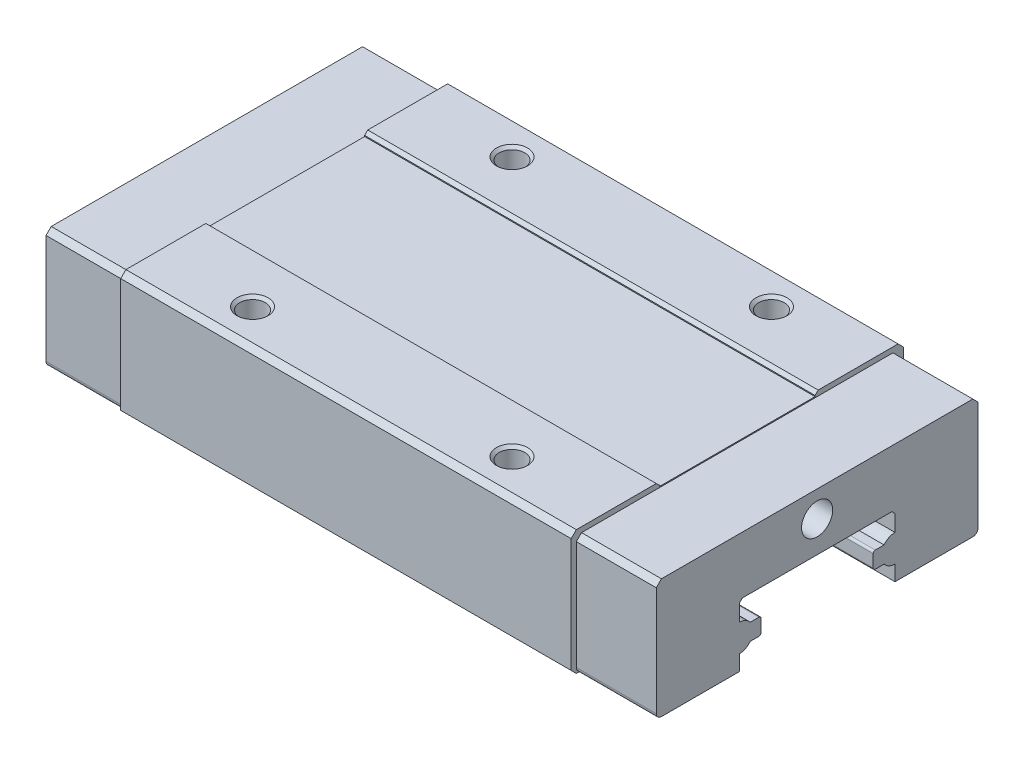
ISO-10303-21;
HEADER;
FILE_DESCRIPTION(('STEP AP214'),'2;1');
FILE_NAME('part.step','',(''),(''),'','','');
FILE_SCHEMA(('AUTOMOTIVE_DESIGN { 1 0 10303 214 1 1 1 1 }'));
ENDSEC;
DATA;
#1=APPLICATION_CONTEXT('core data for automotive mechanical design processes');
#2=APPLICATION_PROTOCOL_DEFINITION('international standard','automotive_design',2000,#1);
#3=PRODUCT_CONTEXT('',#1,'mechanical');
#4=PRODUCT('Part','Part','',(#3));
#5=PRODUCT_RELATED_PRODUCT_CATEGORY('part','',(#4));
#6=PRODUCT_DEFINITION_FORMATION('','',#4);
#7=PRODUCT_DEFINITION_CONTEXT('part definition',#1,'design');
#8=PRODUCT_DEFINITION('design','',#6,#7);
#9=PRODUCT_DEFINITION_SHAPE('','',#8);
#10=(LENGTH_UNIT() NAMED_UNIT(*) SI_UNIT(.MILLI.,.METRE.));
#11=(NAMED_UNIT(*) PLANE_ANGLE_UNIT() SI_UNIT($,.RADIAN.));
#12=(NAMED_UNIT(*) SI_UNIT($,.STERADIAN.) SOLID_ANGLE_UNIT());
#13=UNCERTAINTY_MEASURE_WITH_UNIT(LENGTH_MEASURE(1.E-05),#10,'distance_accuracy_value','');
#14=(GEOMETRIC_REPRESENTATION_CONTEXT(3) GLOBAL_UNCERTAINTY_ASSIGNED_CONTEXT((#13)) GLOBAL_UNIT_ASSIGNED_CONTEXT((#10,
#11,#12)) REPRESENTATION_CONTEXT('',''));
#15=CARTESIAN_POINT('',(0.,0.,0.));
#16=DIRECTION('',(0.,0.,1.));
#17=DIRECTION('',(1.,0.,0.));
#18=AXIS2_PLACEMENT_3D('',#15,#16,#17);
#19=CARTESIAN_POINT('',(16.9,12.,12.5));
#20=DIRECTION('',(0.,1.,0.));
#21=DIRECTION('',(0.,0.,1.));
#22=AXIS2_PLACEMENT_3D('',#19,#20,#21);
#23=CONICAL_SURFACE('',#22,1.5,0.7853981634);
#24=CARTESIAN_POINT('',(16.9,12.,12.5));
#25=DIRECTION('',(0.,-1.,0.));
#26=DIRECTION('',(0.,0.,-1.));
#27=AXIS2_PLACEMENT_3D('',#24,#25,#26);
#28=CIRCLE('',#27,1.5);
#29=CARTESIAN_POINT('',(16.9,12.,11.));
#30=VERTEX_POINT('',#29);
#31=EDGE_CURVE('E39',#30,#30,#28,.T.);
#32=ORIENTED_EDGE('',*,*,#31,.F.);
#33=EDGE_LOOP('',(#32));
#34=FACE_BOUND('',#33,.T.);
#35=CARTESIAN_POINT('',(16.9,11.7295,12.5));
#36=DIRECTION('',(0.,-1.,0.));
#37=DIRECTION('',(0.,0.,-1.));
#38=AXIS2_PLACEMENT_3D('',#35,#36,#37);
#39=CIRCLE('',#38,1.2295);
#40=CARTESIAN_POINT('',(16.9,11.7295,11.2705));
#41=VERTEX_POINT('',#40);
#42=EDGE_CURVE('E10',#41,#41,#39,.T.);
#43=ORIENTED_EDGE('',*,*,#42,.T.);
#44=EDGE_LOOP('',(#43));
#45=FACE_BOUND('',#44,.T.);
#46=ADVANCED_FACE('F16',(#34,#45),#23,.F.);
#47=CARTESIAN_POINT('',(16.9,8.,12.5));
#48=DIRECTION('',(0.,1.,0.));
#49=DIRECTION('',(0.,0.,-1.));
#50=AXIS2_PLACEMENT_3D('',#47,#48,#49);
#51=CYLINDRICAL_SURFACE('',#50,1.2295);
#52=ORIENTED_EDGE('',*,*,#42,.F.);
#53=EDGE_LOOP('',(#52));
#54=FACE_BOUND('',#53,.T.);
#55=CARTESIAN_POINT('',(16.9,8.,12.5));
#56=DIRECTION('',(0.,-1.,0.));
#57=DIRECTION('',(0.,0.,-1.));
#58=AXIS2_PLACEMENT_3D('',#55,#56,#57);
#59=CIRCLE('',#58,1.2295);
#60=CARTESIAN_POINT('',(16.9,8.,11.2705));
#61=VERTEX_POINT('',#60);
#62=EDGE_CURVE('E27',#61,#61,#59,.T.);
#63=ORIENTED_EDGE('',*,*,#62,.T.);
#64=EDGE_LOOP('',(#63));
#65=FACE_BOUND('',#64,.T.);
#66=ADVANCED_FACE('F1279',(#54,#65),#51,.F.);
#67=CARTESIAN_POINT('',(109.9,11.,15.5));
#68=DIRECTION('',(0.,0.,-1.));
#69=DIRECTION('',(0.,-1.,0.));
#70=AXIS2_PLACEMENT_3D('',#67,#68,#69);
#71=PLANE('',#70);
#72=DIRECTION('',(0.,1.,0.));
#73=VECTOR('',#72,1.);
#74=CARTESIAN_POINT('',(58.8,2.8,15.5));
#75=LINE('',#74,#73);
#76=CARTESIAN_POINT('',(58.8,0.5,15.5));
#77=VERTEX_POINT('',#76);
#78=CARTESIAN_POINT('',(58.8,11.,15.5));
#79=VERTEX_POINT('',#78);
#80=EDGE_CURVE('E883',#77,#79,#75,.T.);
#81=ORIENTED_EDGE('',*,*,#80,.T.);
#82=DIRECTION('',(-1.,0.,0.));
#83=VECTOR('',#82,1.);
#84=CARTESIAN_POINT('',(109.9,11.,15.5));
#85=LINE('',#84,#83);
#86=CARTESIAN_POINT('',(51.1,11.,15.5));
#87=VERTEX_POINT('',#86);
#88=EDGE_CURVE('E887',#79,#87,#85,.T.);
#89=ORIENTED_EDGE('',*,*,#88,.T.);
#90=DIRECTION('',(0.,-1.,0.));
#91=VECTOR('',#90,1.);
#92=CARTESIAN_POINT('',(51.1,11.,15.5));
#93=LINE('',#92,#91);
#94=CARTESIAN_POINT('',(51.1,0.5,15.5));
#95=VERTEX_POINT('',#94);
#96=EDGE_CURVE('E486',#87,#95,#93,.T.);
#97=ORIENTED_EDGE('',*,*,#96,.T.);
#98=DIRECTION('',(-1.,0.,0.));
#99=VECTOR('',#98,1.);
#100=CARTESIAN_POINT('',(109.9,0.5,15.5));
#101=LINE('',#100,#99);
#102=EDGE_CURVE('E678',#77,#95,#101,.T.);
#103=ORIENTED_EDGE('',*,*,#102,.F.);
#104=EDGE_LOOP('',(#81,#89,#97,#103));
#105=FACE_BOUND('',#104,.T.);
#106=ADVANCED_FACE('F1285',(#105),#71,.F.);
#107=CARTESIAN_POINT('',(58.8,12.,-15.5));
#108=DIRECTION('',(0.,-1.,0.));
#109=DIRECTION('',(0.,0.,-1.));
#110=AXIS2_PLACEMENT_3D('',#107,#108,#109);
#111=PLANE('',#110);
#112=DIRECTION('',(-1.,0.,0.));
#113=VECTOR('',#112,1.);
#114=CARTESIAN_POINT('',(58.8,12.,7.8));
#115=LINE('',#114,#113);
#116=CARTESIAN_POINT('',(51.1,12.,7.8));
#117=VERTEX_POINT('',#116);
#118=CARTESIAN_POINT('',(7.7,12.,7.8));
#119=VERTEX_POINT('',#118);
#120=EDGE_CURVE('E482',#117,#119,#115,.T.);
#121=ORIENTED_EDGE('',*,*,#120,.T.);
#122=DIRECTION('',(0.,0.,1.));
#123=VECTOR('',#122,1.);
#124=CARTESIAN_POINT('',(7.7,12.,-16.));
#125=LINE('',#124,#123);
#126=CARTESIAN_POINT('',(7.7,12.,15.5));
#127=VERTEX_POINT('',#126);
#128=EDGE_CURVE('E487',#119,#127,#125,.T.);
#129=ORIENTED_EDGE('',*,*,#128,.T.);
#130=DIRECTION('',(-1.,0.,0.));
#131=VECTOR('',#130,1.);
#132=CARTESIAN_POINT('',(58.8,12.,15.5));
#133=LINE('',#132,#131);
#134=CARTESIAN_POINT('',(51.1,12.,15.5));
#135=VERTEX_POINT('',#134);
#136=EDGE_CURVE('E435',#135,#127,#133,.T.);
#137=ORIENTED_EDGE('',*,*,#136,.F.);
#138=DIRECTION('',(0.,0.,1.));
#139=VECTOR('',#138,1.);
#140=CARTESIAN_POINT('',(51.1,12.,-16.));
#141=LINE('',#140,#139);
#142=EDGE_CURVE('E516',#117,#135,#141,.T.);
#143=ORIENTED_EDGE('',*,*,#142,.F.);
#144=EDGE_LOOP('',(#121,#129,#137,#143));
#145=FACE_BOUND('',#144,.T.);
#146=ORIENTED_EDGE('',*,*,#31,.T.);
#147=EDGE_LOOP('',(#146));
#148=FACE_BOUND('',#147,.T.);
#149=CARTESIAN_POINT('',(41.9,12.,12.5));
#150=DIRECTION('',(0.,-1.,0.));
#151=DIRECTION('',(0.,0.,-1.));
#152=AXIS2_PLACEMENT_3D('',#149,#150,#151);
#153=CIRCLE('',#152,1.5);
#154=CARTESIAN_POINT('',(41.9,12.,11.));
#155=VERTEX_POINT('',#154);
#156=EDGE_CURVE('E454',#155,#155,#153,.T.);
#157=ORIENTED_EDGE('',*,*,#156,.T.);
#158=EDGE_LOOP('',(#157));
#159=FACE_BOUND('',#158,.T.);
#160=ADVANCED_FACE('F909',(#145,#148,#159),#111,.F.);
#161=CARTESIAN_POINT('',(58.8,12.,-15.5));
#162=DIRECTION('',(0.,-1.,0.));
#163=DIRECTION('',(0.,0.,-1.));
#164=AXIS2_PLACEMENT_3D('',#161,#162,#163);
#165=PLANE('',#164);
#166=DIRECTION('',(-1.,0.,0.));
#167=VECTOR('',#166,1.);
#168=CARTESIAN_POINT('',(58.8,12.,-7.8));
#169=LINE('',#168,#167);
#170=CARTESIAN_POINT('',(51.1,12.,-7.8));
#171=VERTEX_POINT('',#170);
#172=CARTESIAN_POINT('',(7.7,12.,-7.8));
#173=VERTEX_POINT('',#172);
#174=EDGE_CURVE('E447',#171,#173,#169,.T.);
#175=ORIENTED_EDGE('',*,*,#174,.F.);
#176=DIRECTION('',(0.,0.,1.));
#177=VECTOR('',#176,1.);
#178=CARTESIAN_POINT('',(51.1,12.,-16.));
#179=LINE('',#178,#177);
#180=CARTESIAN_POINT('',(51.1,12.,-15.5));
#181=VERTEX_POINT('',#180);
#182=EDGE_CURVE('E760',#181,#171,#179,.T.);
#183=ORIENTED_EDGE('',*,*,#182,.F.);
#184=DIRECTION('',(-1.,0.,0.));
#185=VECTOR('',#184,1.);
#186=CARTESIAN_POINT('',(58.8,12.,-15.5));
#187=LINE('',#186,#185);
#188=CARTESIAN_POINT('',(7.7,12.,-15.5));
#189=VERTEX_POINT('',#188);
#190=EDGE_CURVE('E458',#181,#189,#187,.T.);
#191=ORIENTED_EDGE('',*,*,#190,.T.);
#192=DIRECTION('',(0.,0.,1.));
#193=VECTOR('',#192,1.);
#194=CARTESIAN_POINT('',(7.7,12.,-16.));
#195=LINE('',#194,#193);
#196=EDGE_CURVE('E804',#189,#173,#195,.T.);
#197=ORIENTED_EDGE('',*,*,#196,.T.);
#198=EDGE_LOOP('',(#175,#183,#191,#197));
#199=FACE_BOUND('',#198,.T.);
#200=CARTESIAN_POINT('',(16.9,12.,-12.5));
#201=DIRECTION('',(0.,-1.,0.));
#202=DIRECTION('',(0.,0.,-1.));
#203=AXIS2_PLACEMENT_3D('',#200,#201,#202);
#204=CIRCLE('',#203,1.5);
#205=CARTESIAN_POINT('',(16.9,12.,-14.));
#206=VERTEX_POINT('',#205);
#207=EDGE_CURVE('E800',#206,#206,#204,.T.);
#208=ORIENTED_EDGE('',*,*,#207,.T.);
#209=EDGE_LOOP('',(#208));
#210=FACE_BOUND('',#209,.T.);
#211=CARTESIAN_POINT('',(41.9,12.,-12.5));
#212=DIRECTION('',(0.,-1.,0.));
#213=DIRECTION('',(0.,0.,-1.));
#214=AXIS2_PLACEMENT_3D('',#211,#212,#213);
#215=CIRCLE('',#214,1.5);
#216=CARTESIAN_POINT('',(41.9,12.,-14.));
#217=VERTEX_POINT('',#216);
#218=EDGE_CURVE('E469',#217,#217,#215,.T.);
#219=ORIENTED_EDGE('',*,*,#218,.T.);
#220=EDGE_LOOP('',(#219));
#221=FACE_BOUND('',#220,.T.);
#222=ADVANCED_FACE('F1327',(#199,#210,#221),#165,.F.);
#223=CARTESIAN_POINT('',(58.8,11.5,-16.));
#224=DIRECTION('',(0.,-0.707106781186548,0.707106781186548));
#225=DIRECTION('',(-1.,0.,0.));
#226=AXIS2_PLACEMENT_3D('',#223,#224,#225);
#227=PLANE('',#226);
#228=DIRECTION('',(0.,0.707106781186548,0.707106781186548));
#229=VECTOR('',#228,1.);
#230=CARTESIAN_POINT('',(51.1,11.5,-16.));
#231=LINE('',#230,#229);
#232=CARTESIAN_POINT('',(51.1,11.5,-16.));
#233=VERTEX_POINT('',#232);
#234=EDGE_CURVE('E563',#233,#181,#231,.T.);
#235=ORIENTED_EDGE('',*,*,#234,.F.);
#236=DIRECTION('',(-1.,0.,0.));
#237=VECTOR('',#236,1.);
#238=CARTESIAN_POINT('',(58.8,11.5,-16.));
#239=LINE('',#238,#237);
#240=CARTESIAN_POINT('',(7.7,11.5,-16.));
#241=VERTEX_POINT('',#240);
#242=EDGE_CURVE('E465',#233,#241,#239,.T.);
#243=ORIENTED_EDGE('',*,*,#242,.T.);
#244=DIRECTION('',(0.,0.707106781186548,0.707106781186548));
#245=VECTOR('',#244,1.);
#246=CARTESIAN_POINT('',(7.7,11.5,-16.));
#247=LINE('',#246,#245);
#248=EDGE_CURVE('E470',#241,#189,#247,.T.);
#249=ORIENTED_EDGE('',*,*,#248,.T.);
#250=ORIENTED_EDGE('',*,*,#190,.F.);
#251=EDGE_LOOP('',(#235,#243,#249,#250));
#252=FACE_BOUND('',#251,.T.);
#253=ADVANCED_FACE('F1324',(#252),#227,.F.);
#254=CARTESIAN_POINT('',(58.8,0.5,-16.));
#255=DIRECTION('',(0.,0.,1.));
#256=DIRECTION('',(1.,0.,0.));
#257=AXIS2_PLACEMENT_3D('',#254,#255,#256);
#258=PLANE('',#257);
#259=DIRECTION('',(0.,1.,0.));
#260=VECTOR('',#259,1.);
#261=CARTESIAN_POINT('',(51.1,-1.,-16.));
#262=LINE('',#261,#260);
#263=CARTESIAN_POINT('',(51.1,0.5,-16.));
#264=VERTEX_POINT('',#263);
#265=EDGE_CURVE('E558',#264,#233,#262,.T.);
#266=ORIENTED_EDGE('',*,*,#265,.F.);
#267=DIRECTION('',(-1.,0.,0.));
#268=VECTOR('',#267,1.);
#269=CARTESIAN_POINT('',(58.8,0.5,-16.));
#270=LINE('',#269,#268);
#271=CARTESIAN_POINT('',(7.7,0.5,-16.));
#272=VERTEX_POINT('',#271);
#273=EDGE_CURVE('E874',#264,#272,#270,.T.);
#274=ORIENTED_EDGE('',*,*,#273,.T.);
#275=DIRECTION('',(0.,1.,0.));
#276=VECTOR('',#275,1.);
#277=CARTESIAN_POINT('',(7.7,-1.,-16.));
#278=LINE('',#277,#276);
#279=EDGE_CURVE('E746',#272,#241,#278,.T.);
#280=ORIENTED_EDGE('',*,*,#279,.T.);
#281=ORIENTED_EDGE('',*,*,#242,.F.);
#282=EDGE_LOOP('',(#266,#274,#280,#281));
#283=FACE_BOUND('',#282,.T.);
#284=ADVANCED_FACE('F1092',(#283),#258,.F.);
#285=CARTESIAN_POINT('',(58.8,0.,-15.5));
#286=DIRECTION('',(0.,0.707106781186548,0.707106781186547));
#287=DIRECTION('',(1.,0.,0.));
#288=AXIS2_PLACEMENT_3D('',#285,#286,#287);
#289=PLANE('',#288);
#290=DIRECTION('',(0.,0.707106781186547,-0.707106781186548));
#291=VECTOR('',#290,1.);
#292=CARTESIAN_POINT('',(51.1,0.,-15.5));
#293=LINE('',#292,#291);
#294=CARTESIAN_POINT('',(51.1,0.,-15.5));
#295=VERTEX_POINT('',#294);
#296=EDGE_CURVE('E562',#295,#264,#293,.T.);
#297=ORIENTED_EDGE('',*,*,#296,.F.);
#298=DIRECTION('',(-1.,0.,0.));
#299=VECTOR('',#298,1.);
#300=CARTESIAN_POINT('',(58.8,0.,-15.5));
#301=LINE('',#300,#299);
#302=CARTESIAN_POINT('',(7.7,0.,-15.5));
#303=VERTEX_POINT('',#302);
#304=EDGE_CURVE('E742',#295,#303,#301,.T.);
#305=ORIENTED_EDGE('',*,*,#304,.T.);
#306=DIRECTION('',(0.,0.707106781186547,-0.707106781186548));
#307=VECTOR('',#306,1.);
#308=CARTESIAN_POINT('',(7.7,0.,-15.5));
#309=LINE('',#308,#307);
#310=EDGE_CURVE('E747',#303,#272,#309,.T.);
#311=ORIENTED_EDGE('',*,*,#310,.T.);
#312=ORIENTED_EDGE('',*,*,#273,.F.);
#313=EDGE_LOOP('',(#297,#305,#311,#312));
#314=FACE_BOUND('',#313,.T.);
#315=ADVANCED_FACE('F1360',(#314),#289,.F.);
#316=CARTESIAN_POINT('',(58.8,0.,-7.5));
#317=DIRECTION('',(0.,1.,0.));
#318=DIRECTION('',(1.,0.,0.));
#319=AXIS2_PLACEMENT_3D('',#316,#317,#318);
#320=PLANE('',#319);
#321=DIRECTION('',(-1.,0.,0.));
#322=VECTOR('',#321,1.);
#323=CARTESIAN_POINT('',(58.8,0.,-7.5));
#324=LINE('',#323,#322);
#325=CARTESIAN_POINT('',(58.8,0.,-7.5));
#326=VERTEX_POINT('',#325);
#327=CARTESIAN_POINT('',(0.,0.,-7.5));
#328=VERTEX_POINT('',#327);
#329=EDGE_CURVE('E651',#326,#328,#324,.T.);
#330=ORIENTED_EDGE('',*,*,#329,.T.);
#331=DIRECTION('',(0.,0.,-1.));
#332=VECTOR('',#331,1.);
#333=CARTESIAN_POINT('',(0.,0.,-7.5));
#334=LINE('',#333,#332);
#335=CARTESIAN_POINT('',(0.,0.,-15.));
#336=VERTEX_POINT('',#335);
#337=EDGE_CURVE('E647',#328,#336,#334,.T.);
#338=ORIENTED_EDGE('',*,*,#337,.T.);
#339=DIRECTION('',(1.,0.,0.));
#340=VECTOR('',#339,1.);
#341=CARTESIAN_POINT('',(-51.1,0.,-15.));
#342=LINE('',#341,#340);
#343=CARTESIAN_POINT('',(7.7,0.,-15.));
#344=VERTEX_POINT('',#343);
#345=EDGE_CURVE('E652',#336,#344,#342,.T.);
#346=ORIENTED_EDGE('',*,*,#345,.T.);
#347=DIRECTION('',(0.,0.,-1.));
#348=VECTOR('',#347,1.);
#349=CARTESIAN_POINT('',(7.7,0.,-7.5));
#350=LINE('',#349,#348);
#351=EDGE_CURVE('E961',#344,#303,#350,.T.);
#352=ORIENTED_EDGE('',*,*,#351,.T.);
#353=ORIENTED_EDGE('',*,*,#304,.F.);
#354=DIRECTION('',(0.,0.,-1.));
#355=VECTOR('',#354,1.);
#356=CARTESIAN_POINT('',(51.1,0.,-7.5));
#357=LINE('',#356,#355);
#358=CARTESIAN_POINT('',(51.1,0.,-15.));
#359=VERTEX_POINT('',#358);
#360=EDGE_CURVE('E574',#359,#295,#357,.T.);
#361=ORIENTED_EDGE('',*,*,#360,.F.);
#362=DIRECTION('',(-1.,0.,0.));
#363=VECTOR('',#362,1.);
#364=CARTESIAN_POINT('',(109.9,0.,-15.));
#365=LINE('',#364,#363);
#366=CARTESIAN_POINT('',(58.8,0.,-15.));
#367=VERTEX_POINT('',#366);
#368=EDGE_CURVE('E617',#367,#359,#365,.T.);
#369=ORIENTED_EDGE('',*,*,#368,.F.);
#370=DIRECTION('',(0.,0.,-1.));
#371=VECTOR('',#370,1.);
#372=CARTESIAN_POINT('',(58.8,0.,-7.5));
#373=LINE('',#372,#371);
#374=EDGE_CURVE('E488',#326,#367,#373,.T.);
#375=ORIENTED_EDGE('',*,*,#374,.F.);
#376=EDGE_LOOP('',(#330,#338,#346,#352,#353,#361,#369,#375));
#377=FACE_BOUND('',#376,.T.);
#378=ADVANCED_FACE('F1359',(#377),#320,.F.);
#379=CARTESIAN_POINT('',(58.8,1.47996212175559,-7.5));
#380=DIRECTION('',(0.,0.,-1.));
#381=DIRECTION('',(0.,-1.,0.));
#382=AXIS2_PLACEMENT_3D('',#379,#380,#381);
#383=PLANE('',#382);
#384=DIRECTION('',(0.,-1.,0.));
#385=VECTOR('',#384,1.);
#386=CARTESIAN_POINT('',(0.,1.47996212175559,-7.5));
#387=LINE('',#386,#385);
#388=CARTESIAN_POINT('',(0.,1.47996212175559,-7.5));
#389=VERTEX_POINT('',#388);
#390=EDGE_CURVE('E598',#389,#328,#387,.T.);
#391=ORIENTED_EDGE('',*,*,#390,.T.);
#392=ORIENTED_EDGE('',*,*,#329,.F.);
#393=DIRECTION('',(0.,-1.,0.));
#394=VECTOR('',#393,1.);
#395=CARTESIAN_POINT('',(58.8,1.47996212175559,-7.5));
#396=LINE('',#395,#394);
#397=CARTESIAN_POINT('',(58.8,1.47996212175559,-7.5));
#398=VERTEX_POINT('',#397);
#399=EDGE_CURVE('E492',#398,#326,#396,.T.);
#400=ORIENTED_EDGE('',*,*,#399,.F.);
#401=DIRECTION('',(-1.,0.,0.));
#402=VECTOR('',#401,1.);
#403=CARTESIAN_POINT('',(58.8,1.47996212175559,-7.5));
#404=LINE('',#403,#402);
#405=EDGE_CURVE('E594',#398,#389,#404,.T.);
#406=ORIENTED_EDGE('',*,*,#405,.T.);
#407=EDGE_LOOP('',(#391,#392,#400,#406));
#408=FACE_BOUND('',#407,.T.);
#409=ADVANCED_FACE('F1355',(#408),#383,.F.);
#410=CARTESIAN_POINT('',(58.8,2.8,-7.5));
#411=DIRECTION('',(1.,0.,0.));
#412=DIRECTION('',(0.,0.,1.));
#413=AXIS2_PLACEMENT_3D('',#410,#411,#412);
#414=CYLINDRICAL_SURFACE('',#413,1.3200378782);
#415=CARTESIAN_POINT('',(0.,2.8,-7.5));
#416=DIRECTION('',(1.,0.,0.));
#417=DIRECTION('',(0.,0.,-1.));
#418=AXIS2_PLACEMENT_3D('',#415,#416,#417);
#419=CIRCLE('',#418,1.3200378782);
#420=CARTESIAN_POINT('',(0.,2.,-6.45));
#421=VERTEX_POINT('',#420);
#422=EDGE_CURVE('E599',#421,#389,#419,.T.);
#423=ORIENTED_EDGE('',*,*,#422,.T.);
#424=ORIENTED_EDGE('',*,*,#405,.F.);
#425=CARTESIAN_POINT('',(58.8,2.8,-7.5));
#426=DIRECTION('',(1.,0.,0.));
#427=DIRECTION('',(0.,0.,-1.));
#428=AXIS2_PLACEMENT_3D('',#425,#426,#427);
#429=CIRCLE('',#428,1.3200378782);
#430=CARTESIAN_POINT('',(58.8,2.,-6.45));
#431=VERTEX_POINT('',#430);
#432=EDGE_CURVE('E794',#431,#398,#429,.T.);
#433=ORIENTED_EDGE('',*,*,#432,.F.);
#434=DIRECTION('',(-1.,0.,0.));
#435=VECTOR('',#434,1.);
#436=CARTESIAN_POINT('',(58.8,2.,-6.45));
#437=LINE('',#436,#435);
#438=EDGE_CURVE('E646',#431,#421,#437,.T.);
#439=ORIENTED_EDGE('',*,*,#438,.T.);
#440=EDGE_LOOP('',(#423,#424,#433,#439));
#441=FACE_BOUND('',#440,.T.);
#442=ADVANCED_FACE('F1358',(#441),#414,.T.);
#443=CARTESIAN_POINT('',(58.8,2.,-5.6));
#444=DIRECTION('',(0.,1.,0.));
#445=DIRECTION('',(1.,0.,0.));
#446=AXIS2_PLACEMENT_3D('',#443,#444,#445);
#447=PLANE('',#446);
#448=DIRECTION('',(0.,0.,-1.));
#449=VECTOR('',#448,1.);
#450=CARTESIAN_POINT('',(0.,2.,-5.6));
#451=LINE('',#450,#449);
#452=CARTESIAN_POINT('',(0.,2.,-5.6));
#453=VERTEX_POINT('',#452);
#454=EDGE_CURVE('E671',#453,#421,#451,.T.);
#455=ORIENTED_EDGE('',*,*,#454,.T.);
#456=ORIENTED_EDGE('',*,*,#438,.F.);
#457=DIRECTION('',(0.,0.,-1.));
#458=VECTOR('',#457,1.);
#459=CARTESIAN_POINT('',(58.8,2.,-5.6));
#460=LINE('',#459,#458);
#461=CARTESIAN_POINT('',(58.8,2.,-5.6));
#462=VERTEX_POINT('',#461);
#463=EDGE_CURVE('E789',#462,#431,#460,.T.);
#464=ORIENTED_EDGE('',*,*,#463,.F.);
#465=DIRECTION('',(-1.,0.,0.));
#466=VECTOR('',#465,1.);
#467=CARTESIAN_POINT('',(58.8,2.,-5.6));
#468=LINE('',#467,#466);
#469=EDGE_CURVE('E668',#462,#453,#468,.T.);
#470=ORIENTED_EDGE('',*,*,#469,.T.);
#471=EDGE_LOOP('',(#455,#456,#464,#470));
#472=FACE_BOUND('',#471,.T.);
#473=ADVANCED_FACE('F1444',(#472),#447,.F.);
#474=CARTESIAN_POINT('',(58.8,2.2,-5.6));
#475=DIRECTION('',(1.,0.,0.));
#476=DIRECTION('',(0.,0.,1.));
#477=AXIS2_PLACEMENT_3D('',#474,#475,#476);
#478=CYLINDRICAL_SURFACE('',#477,0.2);
#479=CARTESIAN_POINT('',(0.,2.2,-5.6));
#480=DIRECTION('',(1.,0.,0.));
#481=DIRECTION('',(0.,0.,-1.));
#482=AXIS2_PLACEMENT_3D('',#479,#480,#481);
#483=CIRCLE('',#482,0.2);
#484=CARTESIAN_POINT('',(0.,2.2,-5.4));
#485=VERTEX_POINT('',#484);
#486=EDGE_CURVE('E672',#485,#453,#483,.T.);
#487=ORIENTED_EDGE('',*,*,#486,.T.);
#488=ORIENTED_EDGE('',*,*,#469,.F.);
#489=CARTESIAN_POINT('',(58.8,2.2,-5.6));
#490=DIRECTION('',(1.,0.,0.));
#491=DIRECTION('',(0.,0.,-1.));
#492=AXIS2_PLACEMENT_3D('',#489,#490,#491);
#493=CIRCLE('',#492,0.2);
#494=CARTESIAN_POINT('',(58.8,2.2,-5.4));
#495=VERTEX_POINT('',#494);
#496=EDGE_CURVE('E793',#495,#462,#493,.T.);
#497=ORIENTED_EDGE('',*,*,#496,.F.);
#498=DIRECTION('',(-1.,0.,0.));
#499=VECTOR('',#498,1.);
#500=CARTESIAN_POINT('',(58.8,2.2,-5.4));
#501=LINE('',#500,#499);
#502=EDGE_CURVE('E814',#495,#485,#501,.T.);
#503=ORIENTED_EDGE('',*,*,#502,.T.);
#504=EDGE_LOOP('',(#487,#488,#497,#503));
#505=FACE_BOUND('',#504,.T.);
#506=ADVANCED_FACE('F1374',(#505),#478,.T.);
#507=CARTESIAN_POINT('',(58.8,3.4,-5.4));
#508=DIRECTION('',(0.,0.,-1.));
#509=DIRECTION('',(0.,-1.,0.));
#510=AXIS2_PLACEMENT_3D('',#507,#508,#509);
#511=PLANE('',#510);
#512=DIRECTION('',(0.,-1.,0.));
#513=VECTOR('',#512,1.);
#514=CARTESIAN_POINT('',(0.,3.4,-5.4));
#515=LINE('',#514,#513);
#516=CARTESIAN_POINT('',(0.,3.4,-5.4));
#517=VERTEX_POINT('',#516);
#518=EDGE_CURVE('E496',#517,#485,#515,.T.);
#519=ORIENTED_EDGE('',*,*,#518,.T.);
#520=ORIENTED_EDGE('',*,*,#502,.F.);
#521=DIRECTION('',(0.,-1.,0.));
#522=VECTOR('',#521,1.);
#523=CARTESIAN_POINT('',(58.8,3.4,-5.4));
#524=LINE('',#523,#522);
#525=CARTESIAN_POINT('',(58.8,3.4,-5.4));
#526=VERTEX_POINT('',#525);
#527=EDGE_CURVE('E407',#526,#495,#524,.T.);
#528=ORIENTED_EDGE('',*,*,#527,.F.);
#529=DIRECTION('',(-1.,0.,0.));
#530=VECTOR('',#529,1.);
#531=CARTESIAN_POINT('',(58.8,3.4,-5.4));
#532=LINE('',#531,#530);
#533=EDGE_CURVE('E401',#526,#517,#532,.T.);
#534=ORIENTED_EDGE('',*,*,#533,.T.);
#535=EDGE_LOOP('',(#519,#520,#528,#534));
#536=FACE_BOUND('',#535,.T.);
#537=ADVANCED_FACE('F1371',(#536),#511,.F.);
#538=CARTESIAN_POINT('',(58.8,3.4,-5.6));
#539=DIRECTION('',(1.,0.,0.));
#540=DIRECTION('',(0.,0.,1.));
#541=AXIS2_PLACEMENT_3D('',#538,#539,#540);
#542=CYLINDRICAL_SURFACE('',#541,0.2);
#543=CARTESIAN_POINT('',(0.,3.4,-5.6));
#544=DIRECTION('',(1.,0.,0.));
#545=DIRECTION('',(0.,0.,-1.));
#546=AXIS2_PLACEMENT_3D('',#543,#544,#545);
#547=CIRCLE('',#546,0.2);
#548=CARTESIAN_POINT('',(0.,3.6,-5.6));
#549=VERTEX_POINT('',#548);
#550=EDGE_CURVE('E417',#549,#517,#547,.T.);
#551=ORIENTED_EDGE('',*,*,#550,.T.);
#552=ORIENTED_EDGE('',*,*,#533,.F.);
#553=CARTESIAN_POINT('',(58.8,3.4,-5.6));
#554=DIRECTION('',(1.,0.,0.));
#555=DIRECTION('',(0.,0.,-1.));
#556=AXIS2_PLACEMENT_3D('',#553,#554,#555);
#557=CIRCLE('',#556,0.2);
#558=CARTESIAN_POINT('',(58.8,3.6,-5.6));
#559=VERTEX_POINT('',#558);
#560=EDGE_CURVE('E395',#559,#526,#557,.T.);
#561=ORIENTED_EDGE('',*,*,#560,.F.);
#562=DIRECTION('',(-1.,0.,0.));
#563=VECTOR('',#562,1.);
#564=CARTESIAN_POINT('',(58.8,3.6,-5.6));
#565=LINE('',#564,#563);
#566=EDGE_CURVE('E399',#559,#549,#565,.T.);
#567=ORIENTED_EDGE('',*,*,#566,.T.);
#568=EDGE_LOOP('',(#551,#552,#561,#567));
#569=FACE_BOUND('',#568,.T.);
#570=ADVANCED_FACE('F398',(#569),#542,.T.);
#571=CARTESIAN_POINT('',(58.8,3.6,-6.45));
#572=DIRECTION('',(0.,-1.,0.));
#573=DIRECTION('',(0.,0.,-1.));
#574=AXIS2_PLACEMENT_3D('',#571,#572,#573);
#575=PLANE('',#574);
#576=DIRECTION('',(0.,0.,1.));
#577=VECTOR('',#576,1.);
#578=CARTESIAN_POINT('',(0.,3.6,-6.45));
#579=LINE('',#578,#577);
#580=CARTESIAN_POINT('',(0.,3.6,-6.45));
#581=VERTEX_POINT('',#580);
#582=EDGE_CURVE('E415',#581,#549,#579,.T.);
#583=ORIENTED_EDGE('',*,*,#582,.T.);
#584=ORIENTED_EDGE('',*,*,#566,.F.);
#585=DIRECTION('',(0.,0.,1.));
#586=VECTOR('',#585,1.);
#587=CARTESIAN_POINT('',(58.8,3.6,-6.45));
#588=LINE('',#587,#586);
#589=CARTESIAN_POINT('',(58.8,3.6,-6.45));
#590=VERTEX_POINT('',#589);
#591=EDGE_CURVE('E406',#590,#559,#588,.T.);
#592=ORIENTED_EDGE('',*,*,#591,.F.);
#593=DIRECTION('',(-1.,0.,0.));
#594=VECTOR('',#593,1.);
#595=CARTESIAN_POINT('',(58.8,3.6,-6.45));
#596=LINE('',#595,#594);
#597=EDGE_CURVE('E750',#590,#581,#596,.T.);
#598=ORIENTED_EDGE('',*,*,#597,.T.);
#599=EDGE_LOOP('',(#583,#584,#592,#598));
#600=FACE_BOUND('',#599,.T.);
#601=ADVANCED_FACE('F411',(#600),#575,.F.);
#602=CARTESIAN_POINT('',(58.8,2.8,-7.5));
#603=DIRECTION('',(1.,0.,0.));
#604=DIRECTION('',(0.,0.,1.));
#605=AXIS2_PLACEMENT_3D('',#602,#603,#604);
#606=CYLINDRICAL_SURFACE('',#605,1.3200378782);
#607=CARTESIAN_POINT('',(0.,2.8,-7.5));
#608=DIRECTION('',(1.,0.,0.));
#609=DIRECTION('',(0.,0.,-1.));
#610=AXIS2_PLACEMENT_3D('',#607,#608,#609);
#611=CIRCLE('',#610,1.3200378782);
#612=CARTESIAN_POINT('',(0.,4.12003787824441,-7.5));
#613=VERTEX_POINT('',#612);
#614=EDGE_CURVE('E777',#613,#581,#611,.T.);
#615=ORIENTED_EDGE('',*,*,#614,.T.);
#616=ORIENTED_EDGE('',*,*,#597,.F.);
#617=CARTESIAN_POINT('',(58.8,2.8,-7.5));
#618=DIRECTION('',(1.,0.,0.));
#619=DIRECTION('',(0.,0.,-1.));
#620=AXIS2_PLACEMENT_3D('',#617,#618,#619);
#621=CIRCLE('',#620,1.3200378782);
#622=CARTESIAN_POINT('',(58.8,4.12003787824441,-7.5));
#623=VERTEX_POINT('',#622);
#624=EDGE_CURVE('E424',#623,#590,#621,.T.);
#625=ORIENTED_EDGE('',*,*,#624,.F.);
#626=DIRECTION('',(-1.,0.,0.));
#627=VECTOR('',#626,1.);
#628=CARTESIAN_POINT('',(58.8,4.12003787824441,-7.5));
#629=LINE('',#628,#627);
#630=EDGE_CURVE('E773',#623,#613,#629,.T.);
#631=ORIENTED_EDGE('',*,*,#630,.T.);
#632=EDGE_LOOP('',(#615,#616,#625,#631));
#633=FACE_BOUND('',#632,.T.);
#634=ADVANCED_FACE('F1209',(#633),#606,.T.);
#635=CARTESIAN_POINT('',(58.8,5.7,-7.5));
#636=DIRECTION('',(0.,0.,-1.));
#637=DIRECTION('',(0.,-1.,0.));
#638=AXIS2_PLACEMENT_3D('',#635,#636,#637);
#639=PLANE('',#638);
#640=DIRECTION('',(0.,-1.,0.));
#641=VECTOR('',#640,1.);
#642=CARTESIAN_POINT('',(0.,5.7,-7.5));
#643=LINE('',#642,#641);
#644=CARTESIAN_POINT('',(0.,5.7,-7.5));
#645=VERTEX_POINT('',#644);
#646=EDGE_CURVE('E474',#645,#613,#643,.T.);
#647=ORIENTED_EDGE('',*,*,#646,.T.);
#648=ORIENTED_EDGE('',*,*,#630,.F.);
#649=DIRECTION('',(0.,-1.,0.));
#650=VECTOR('',#649,1.);
#651=CARTESIAN_POINT('',(58.8,5.7,-7.5));
#652=LINE('',#651,#650);
#653=CARTESIAN_POINT('',(58.8,5.7,-7.5));
#654=VERTEX_POINT('',#653);
#655=EDGE_CURVE('E431',#654,#623,#652,.T.);
#656=ORIENTED_EDGE('',*,*,#655,.F.);
#657=DIRECTION('',(-1.,0.,0.));
#658=VECTOR('',#657,1.);
#659=CARTESIAN_POINT('',(58.8,5.7,-7.5));
#660=LINE('',#659,#658);
#661=EDGE_CURVE('E471',#654,#645,#660,.T.);
#662=ORIENTED_EDGE('',*,*,#661,.T.);
#663=EDGE_LOOP('',(#647,#648,#656,#662));
#664=FACE_BOUND('',#663,.T.);
#665=ADVANCED_FACE('F1212',(#664),#639,.F.);
#666=CARTESIAN_POINT('',(58.8,6.,-7.2));
#667=DIRECTION('',(0.,0.707106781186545,-0.70710678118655));
#668=DIRECTION('',(-1.,0.,0.));
#669=AXIS2_PLACEMENT_3D('',#666,#667,#668);
#670=PLANE('',#669);
#671=DIRECTION('',(0.,-0.70710678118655,-0.707106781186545));
#672=VECTOR('',#671,1.);
#673=CARTESIAN_POINT('',(0.,6.,-7.2));
#674=LINE('',#673,#672);
#675=CARTESIAN_POINT('',(0.,6.,-7.2));
#676=VERTEX_POINT('',#675);
#677=EDGE_CURVE('E475',#676,#645,#674,.T.);
#678=ORIENTED_EDGE('',*,*,#677,.T.);
#679=ORIENTED_EDGE('',*,*,#661,.F.);
#680=DIRECTION('',(0.,-0.70710678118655,-0.707106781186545));
#681=VECTOR('',#680,1.);
#682=CARTESIAN_POINT('',(58.8,6.,-7.2));
#683=LINE('',#682,#681);
#684=CARTESIAN_POINT('',(58.8,6.,-7.2));
#685=VERTEX_POINT('',#684);
#686=EDGE_CURVE('E641',#685,#654,#683,.T.);
#687=ORIENTED_EDGE('',*,*,#686,.F.);
#688=DIRECTION('',(-1.,0.,0.));
#689=VECTOR('',#688,1.);
#690=CARTESIAN_POINT('',(58.8,6.,-7.2));
#691=LINE('',#690,#689);
#692=EDGE_CURVE('E732',#685,#676,#691,.T.);
#693=ORIENTED_EDGE('',*,*,#692,.T.);
#694=EDGE_LOOP('',(#678,#679,#687,#693));
#695=FACE_BOUND('',#694,.T.);
#696=ADVANCED_FACE('F1216',(#695),#670,.F.);
#697=CARTESIAN_POINT('',(58.8,6.,7.2));
#698=DIRECTION('',(0.,1.,0.));
#699=DIRECTION('',(1.,0.,0.));
#700=AXIS2_PLACEMENT_3D('',#697,#698,#699);
#701=PLANE('',#700);
#702=DIRECTION('',(0.,0.,-1.));
#703=VECTOR('',#702,1.);
#704=CARTESIAN_POINT('',(0.,6.,7.2));
#705=LINE('',#704,#703);
#706=CARTESIAN_POINT('',(0.,6.,7.2));
#707=VERTEX_POINT('',#706);
#708=EDGE_CURVE('E736',#707,#676,#705,.T.);
#709=ORIENTED_EDGE('',*,*,#708,.T.);
#710=ORIENTED_EDGE('',*,*,#692,.F.);
#711=DIRECTION('',(0.,0.,-1.));
#712=VECTOR('',#711,1.);
#713=CARTESIAN_POINT('',(58.8,6.,7.2));
#714=LINE('',#713,#712);
#715=CARTESIAN_POINT('',(58.8,6.,7.2));
#716=VERTEX_POINT('',#715);
#717=EDGE_CURVE('E891',#716,#685,#714,.T.);
#718=ORIENTED_EDGE('',*,*,#717,.F.);
#719=DIRECTION('',(-1.,0.,0.));
#720=VECTOR('',#719,1.);
#721=CARTESIAN_POINT('',(58.8,6.,7.2));
#722=LINE('',#721,#720);
#723=EDGE_CURVE('E684',#716,#707,#722,.T.);
#724=ORIENTED_EDGE('',*,*,#723,.T.);
#725=EDGE_LOOP('',(#709,#710,#718,#724));
#726=FACE_BOUND('',#725,.T.);
#727=ADVANCED_FACE('F1219',(#726),#701,.F.);
#728=CARTESIAN_POINT('',(58.8,5.7,7.5));
#729=DIRECTION('',(0.,0.707106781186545,0.70710678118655));
#730=DIRECTION('',(1.,0.,0.));
#731=AXIS2_PLACEMENT_3D('',#728,#729,#730);
#732=PLANE('',#731);
#733=DIRECTION('',(0.,0.70710678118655,-0.707106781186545));
#734=VECTOR('',#733,1.);
#735=CARTESIAN_POINT('',(0.,5.7,7.5));
#736=LINE('',#735,#734);
#737=CARTESIAN_POINT('',(0.,5.7,7.5));
#738=VERTEX_POINT('',#737);
#739=EDGE_CURVE('E582',#738,#707,#736,.T.);
#740=ORIENTED_EDGE('',*,*,#739,.T.);
#741=ORIENTED_EDGE('',*,*,#723,.F.);
#742=DIRECTION('',(0.,0.70710678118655,-0.707106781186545));
#743=VECTOR('',#742,1.);
#744=CARTESIAN_POINT('',(58.8,5.7,7.5));
#745=LINE('',#744,#743);
#746=CARTESIAN_POINT('',(58.8,5.7,7.5));
#747=VERTEX_POINT('',#746);
#748=EDGE_CURVE('E1019',#747,#716,#745,.T.);
#749=ORIENTED_EDGE('',*,*,#748,.F.);
#750=DIRECTION('',(-1.,0.,0.));
#751=VECTOR('',#750,1.);
#752=CARTESIAN_POINT('',(58.8,5.7,7.5));
#753=LINE('',#752,#751);
#754=EDGE_CURVE('E525',#747,#738,#753,.T.);
#755=ORIENTED_EDGE('',*,*,#754,.T.);
#756=EDGE_LOOP('',(#740,#741,#749,#755));
#757=FACE_BOUND('',#756,.T.);
#758=ADVANCED_FACE('F1225',(#757),#732,.F.);
#759=CARTESIAN_POINT('',(58.8,4.12003787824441,7.5));
#760=DIRECTION('',(0.,0.,1.));
#761=DIRECTION('',(1.,0.,0.));
#762=AXIS2_PLACEMENT_3D('',#759,#760,#761);
#763=PLANE('',#762);
#764=DIRECTION('',(0.,1.,0.));
#765=VECTOR('',#764,1.);
#766=CARTESIAN_POINT('',(0.,4.12003787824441,7.5));
#767=LINE('',#766,#765);
#768=CARTESIAN_POINT('',(0.,4.12003787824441,7.5));
#769=VERTEX_POINT('',#768);
#770=EDGE_CURVE('E521',#769,#738,#767,.T.);
#771=ORIENTED_EDGE('',*,*,#770,.T.);
#772=ORIENTED_EDGE('',*,*,#754,.F.);
#773=DIRECTION('',(0.,1.,0.));
#774=VECTOR('',#773,1.);
#775=CARTESIAN_POINT('',(58.8,4.12003787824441,7.5));
#776=LINE('',#775,#774);
#777=CARTESIAN_POINT('',(58.8,4.12003787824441,7.5));
#778=VERTEX_POINT('',#777);
#779=EDGE_CURVE('E1023',#778,#747,#776,.T.);
#780=ORIENTED_EDGE('',*,*,#779,.F.);
#781=DIRECTION('',(-1.,0.,0.));
#782=VECTOR('',#781,1.);
#783=CARTESIAN_POINT('',(58.8,4.12003787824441,7.5));
#784=LINE('',#783,#782);
#785=EDGE_CURVE('E526',#778,#769,#784,.T.);
#786=ORIENTED_EDGE('',*,*,#785,.T.);
#787=EDGE_LOOP('',(#771,#772,#780,#786));
#788=FACE_BOUND('',#787,.T.);
#789=ADVANCED_FACE('F1228',(#788),#763,.F.);
#790=CARTESIAN_POINT('',(58.8,2.8,7.5));
#791=DIRECTION('',(1.,0.,0.));
#792=DIRECTION('',(0.,0.,1.));
#793=AXIS2_PLACEMENT_3D('',#790,#791,#792);
#794=CYLINDRICAL_SURFACE('',#793,1.3200378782);
#795=CARTESIAN_POINT('',(0.,2.8,7.5));
#796=DIRECTION('',(1.,0.,0.));
#797=DIRECTION('',(0.,0.,-1.));
#798=AXIS2_PLACEMENT_3D('',#795,#796,#797);
#799=CIRCLE('',#798,1.3200378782);
#800=CARTESIAN_POINT('',(0.,3.6,6.45));
#801=VERTEX_POINT('',#800);
#802=EDGE_CURVE('E664',#801,#769,#799,.T.);
#803=ORIENTED_EDGE('',*,*,#802,.T.);
#804=ORIENTED_EDGE('',*,*,#785,.F.);
#805=CARTESIAN_POINT('',(58.8,2.8,7.5));
#806=DIRECTION('',(1.,0.,0.));
#807=DIRECTION('',(0.,0.,-1.));
#808=AXIS2_PLACEMENT_3D('',#805,#806,#807);
#809=CIRCLE('',#808,1.3200378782);
#810=CARTESIAN_POINT('',(58.8,3.6,6.45));
#811=VERTEX_POINT('',#810);
#812=EDGE_CURVE('E707',#811,#778,#809,.T.);
#813=ORIENTED_EDGE('',*,*,#812,.F.);
#814=DIRECTION('',(-1.,0.,0.));
#815=VECTOR('',#814,1.);
#816=CARTESIAN_POINT('',(58.8,3.6,6.45));
#817=LINE('',#816,#815);
#818=EDGE_CURVE('E629',#811,#801,#817,.T.);
#819=ORIENTED_EDGE('',*,*,#818,.T.);
#820=EDGE_LOOP('',(#803,#804,#813,#819));
#821=FACE_BOUND('',#820,.T.);
#822=ADVANCED_FACE('F1232',(#821),#794,.T.);
#823=CARTESIAN_POINT('',(58.8,3.6,5.6));
#824=DIRECTION('',(0.,-1.,0.));
#825=DIRECTION('',(0.,0.,-1.));
#826=AXIS2_PLACEMENT_3D('',#823,#824,#825);
#827=PLANE('',#826);
#828=DIRECTION('',(0.,0.,1.));
#829=VECTOR('',#828,1.);
#830=CARTESIAN_POINT('',(0.,3.6,5.6));
#831=LINE('',#830,#829);
#832=CARTESIAN_POINT('',(0.,3.6,5.6));
#833=VERTEX_POINT('',#832);
#834=EDGE_CURVE('E625',#833,#801,#831,.T.);
#835=ORIENTED_EDGE('',*,*,#834,.T.);
#836=ORIENTED_EDGE('',*,*,#818,.F.);
#837=DIRECTION('',(0.,0.,1.));
#838=VECTOR('',#837,1.);
#839=CARTESIAN_POINT('',(58.8,3.6,5.6));
#840=LINE('',#839,#838);
#841=CARTESIAN_POINT('',(58.8,3.6,5.6));
#842=VERTEX_POINT('',#841);
#843=EDGE_CURVE('E702',#842,#811,#840,.T.);
#844=ORIENTED_EDGE('',*,*,#843,.F.);
#845=DIRECTION('',(-1.,0.,0.));
#846=VECTOR('',#845,1.);
#847=CARTESIAN_POINT('',(58.8,3.6,5.6));
#848=LINE('',#847,#846);
#849=EDGE_CURVE('E630',#842,#833,#848,.T.);
#850=ORIENTED_EDGE('',*,*,#849,.T.);
#851=EDGE_LOOP('',(#835,#836,#844,#850));
#852=FACE_BOUND('',#851,.T.);
#853=ADVANCED_FACE('F1235',(#852),#827,.F.);
#854=CARTESIAN_POINT('',(58.8,3.4,5.6));
#855=DIRECTION('',(1.,0.,0.));
#856=DIRECTION('',(0.,0.,1.));
#857=AXIS2_PLACEMENT_3D('',#854,#855,#856);
#858=CYLINDRICAL_SURFACE('',#857,0.2);
#859=CARTESIAN_POINT('',(0.,3.4,5.6));
#860=DIRECTION('',(1.,0.,0.));
#861=DIRECTION('',(0.,0.,-1.));
#862=AXIS2_PLACEMENT_3D('',#859,#860,#861);
#863=CIRCLE('',#862,0.2);
#864=CARTESIAN_POINT('',(0.,3.4,5.4));
#865=VERTEX_POINT('',#864);
#866=EDGE_CURVE('E500',#865,#833,#863,.T.);
#867=ORIENTED_EDGE('',*,*,#866,.T.);
#868=ORIENTED_EDGE('',*,*,#849,.F.);
#869=CARTESIAN_POINT('',(58.8,3.4,5.6));
#870=DIRECTION('',(1.,0.,0.));
#871=DIRECTION('',(0.,0.,-1.));
#872=AXIS2_PLACEMENT_3D('',#869,#870,#871);
#873=CIRCLE('',#872,0.2);
#874=CARTESIAN_POINT('',(58.8,3.4,5.4));
#875=VERTEX_POINT('',#874);
#876=EDGE_CURVE('E706',#875,#842,#873,.T.);
#877=ORIENTED_EDGE('',*,*,#876,.F.);
#878=DIRECTION('',(-1.,0.,0.));
#879=VECTOR('',#878,1.);
#880=CARTESIAN_POINT('',(58.8,3.4,5.4));
#881=LINE('',#880,#879);
#882=EDGE_CURVE('E497',#875,#865,#881,.T.);
#883=ORIENTED_EDGE('',*,*,#882,.T.);
#884=EDGE_LOOP('',(#867,#868,#877,#883));
#885=FACE_BOUND('',#884,.T.);
#886=ADVANCED_FACE('F1242',(#885),#858,.T.);
#887=CARTESIAN_POINT('',(58.8,2.2,5.4));
#888=DIRECTION('',(0.,0.,1.));
#889=DIRECTION('',(1.,0.,0.));
#890=AXIS2_PLACEMENT_3D('',#887,#888,#889);
#891=PLANE('',#890);
#892=DIRECTION('',(0.,1.,0.));
#893=VECTOR('',#892,1.);
#894=CARTESIAN_POINT('',(0.,2.2,5.4));
#895=LINE('',#894,#893);
#896=CARTESIAN_POINT('',(0.,2.2,5.4));
#897=VERTEX_POINT('',#896);
#898=EDGE_CURVE('E501',#897,#865,#895,.T.);
#899=ORIENTED_EDGE('',*,*,#898,.T.);
#900=ORIENTED_EDGE('',*,*,#882,.F.);
#901=DIRECTION('',(0.,1.,0.));
#902=VECTOR('',#901,1.);
#903=CARTESIAN_POINT('',(58.8,2.2,5.4));
#904=LINE('',#903,#902);
#905=CARTESIAN_POINT('',(58.8,2.2,5.4));
#906=VERTEX_POINT('',#905);
#907=EDGE_CURVE('E755',#906,#875,#904,.T.);
#908=ORIENTED_EDGE('',*,*,#907,.F.);
#909=DIRECTION('',(-1.,0.,0.));
#910=VECTOR('',#909,1.);
#911=CARTESIAN_POINT('',(58.8,2.2,5.4));
#912=LINE('',#911,#910);
#913=EDGE_CURVE('E808',#906,#897,#912,.T.);
#914=ORIENTED_EDGE('',*,*,#913,.T.);
#915=EDGE_LOOP('',(#899,#900,#908,#914));
#916=FACE_BOUND('',#915,.T.);
#917=ADVANCED_FACE('F1245',(#916),#891,.F.);
#918=CARTESIAN_POINT('',(58.8,2.2,5.6));
#919=DIRECTION('',(1.,0.,0.));
#920=DIRECTION('',(0.,0.,1.));
#921=AXIS2_PLACEMENT_3D('',#918,#919,#920);
#922=CYLINDRICAL_SURFACE('',#921,0.2);
#923=CARTESIAN_POINT('',(0.,2.2,5.6));
#924=DIRECTION('',(1.,0.,0.));
#925=DIRECTION('',(0.,0.,-1.));
#926=AXIS2_PLACEMENT_3D('',#923,#924,#925);
#927=CIRCLE('',#926,0.2);
#928=CARTESIAN_POINT('',(0.,2.,5.6));
#929=VERTEX_POINT('',#928);
#930=EDGE_CURVE('E740',#929,#897,#927,.T.);
#931=ORIENTED_EDGE('',*,*,#930,.T.);
#932=ORIENTED_EDGE('',*,*,#913,.F.);
#933=CARTESIAN_POINT('',(58.8,2.2,5.6));
#934=DIRECTION('',(1.,0.,0.));
#935=DIRECTION('',(0.,0.,-1.));
#936=AXIS2_PLACEMENT_3D('',#933,#934,#935);
#937=CIRCLE('',#936,0.2);
#938=CARTESIAN_POINT('',(58.8,2.,5.6));
#939=VERTEX_POINT('',#938);
#940=EDGE_CURVE('E751',#939,#906,#937,.T.);
#941=ORIENTED_EDGE('',*,*,#940,.F.);
#942=DIRECTION('',(-1.,0.,0.));
#943=VECTOR('',#942,1.);
#944=CARTESIAN_POINT('',(58.8,2.,5.6));
#945=LINE('',#944,#943);
#946=EDGE_CURVE('E737',#939,#929,#945,.T.);
#947=ORIENTED_EDGE('',*,*,#946,.T.);
#948=EDGE_LOOP('',(#931,#932,#941,#947));
#949=FACE_BOUND('',#948,.T.);
#950=ADVANCED_FACE('F1249',(#949),#922,.T.);
#951=CARTESIAN_POINT('',(58.8,2.,6.45));
#952=DIRECTION('',(0.,1.,0.));
#953=DIRECTION('',(1.,0.,0.));
#954=AXIS2_PLACEMENT_3D('',#951,#952,#953);
#955=PLANE('',#954);
#956=DIRECTION('',(0.,0.,-1.));
#957=VECTOR('',#956,1.);
#958=CARTESIAN_POINT('',(0.,2.,6.45));
#959=LINE('',#958,#957);
#960=CARTESIAN_POINT('',(0.,2.,6.45));
#961=VERTEX_POINT('',#960);
#962=EDGE_CURVE('E741',#961,#929,#959,.T.);
#963=ORIENTED_EDGE('',*,*,#962,.T.);
#964=ORIENTED_EDGE('',*,*,#946,.F.);
#965=DIRECTION('',(0.,0.,-1.));
#966=VECTOR('',#965,1.);
#967=CARTESIAN_POINT('',(58.8,2.,6.45));
#968=LINE('',#967,#966);
#969=CARTESIAN_POINT('',(58.8,2.,6.45));
#970=VERTEX_POINT('',#969);
#971=EDGE_CURVE('E608',#970,#939,#968,.T.);
#972=ORIENTED_EDGE('',*,*,#971,.F.);
#973=DIRECTION('',(-1.,0.,0.));
#974=VECTOR('',#973,1.);
#975=CARTESIAN_POINT('',(58.8,2.,6.45));
#976=LINE('',#975,#974);
#977=EDGE_CURVE('E567',#970,#961,#976,.T.);
#978=ORIENTED_EDGE('',*,*,#977,.T.);
#979=EDGE_LOOP('',(#963,#964,#972,#978));
#980=FACE_BOUND('',#979,.T.);
#981=ADVANCED_FACE('F1252',(#980),#955,.F.);
#982=CARTESIAN_POINT('',(58.8,2.8,7.5));
#983=DIRECTION('',(1.,0.,0.));
#984=DIRECTION('',(0.,0.,1.));
#985=AXIS2_PLACEMENT_3D('',#982,#983,#984);
#986=CYLINDRICAL_SURFACE('',#985,1.3200378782);
#987=CARTESIAN_POINT('',(0.,2.8,7.5));
#988=DIRECTION('',(1.,0.,0.));
#989=DIRECTION('',(0.,0.,-1.));
#990=AXIS2_PLACEMENT_3D('',#987,#988,#989);
#991=CIRCLE('',#990,1.3200378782);
#992=CARTESIAN_POINT('',(0.,1.47996212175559,7.5));
#993=VERTEX_POINT('',#992);
#994=EDGE_CURVE('E544',#993,#961,#991,.T.);
#995=ORIENTED_EDGE('',*,*,#994,.T.);
#996=ORIENTED_EDGE('',*,*,#977,.F.);
#997=CARTESIAN_POINT('',(58.8,2.8,7.5));
#998=DIRECTION('',(1.,0.,0.));
#999=DIRECTION('',(0.,0.,-1.));
#1000=AXIS2_PLACEMENT_3D('',#997,#998,#999);
#1001=CIRCLE('',#1000,1.3200378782);
#1002=CARTESIAN_POINT('',(58.8,1.47996212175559,7.5));
#1003=VERTEX_POINT('',#1002);
#1004=EDGE_CURVE('E604',#1003,#970,#1001,.T.);
#1005=ORIENTED_EDGE('',*,*,#1004,.F.);
#1006=DIRECTION('',(-1.,0.,0.));
#1007=VECTOR('',#1006,1.);
#1008=CARTESIAN_POINT('',(58.8,1.47996212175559,7.5));
#1009=LINE('',#1008,#1007);
#1010=EDGE_CURVE('E540',#1003,#993,#1009,.T.);
#1011=ORIENTED_EDGE('',*,*,#1010,.T.);
#1012=EDGE_LOOP('',(#995,#996,#1005,#1011));
#1013=FACE_BOUND('',#1012,.T.);
#1014=ADVANCED_FACE('F1257',(#1013),#986,.T.);
#1015=CARTESIAN_POINT('',(58.8,0.,7.5));
#1016=DIRECTION('',(0.,0.,1.));
#1017=DIRECTION('',(1.,0.,0.));
#1018=AXIS2_PLACEMENT_3D('',#1015,#1016,#1017);
#1019=PLANE('',#1018);
#1020=DIRECTION('',(0.,1.,0.));
#1021=VECTOR('',#1020,1.);
#1022=CARTESIAN_POINT('',(0.,0.,7.5));
#1023=LINE('',#1022,#1021);
#1024=CARTESIAN_POINT('',(0.,0.,7.5));
#1025=VERTEX_POINT('',#1024);
#1026=EDGE_CURVE('E520',#1025,#993,#1023,.T.);
#1027=ORIENTED_EDGE('',*,*,#1026,.T.);
#1028=ORIENTED_EDGE('',*,*,#1010,.F.);
#1029=DIRECTION('',(0.,1.,0.));
#1030=VECTOR('',#1029,1.);
#1031=CARTESIAN_POINT('',(58.8,0.,7.5));
#1032=LINE('',#1031,#1030);
#1033=CARTESIAN_POINT('',(58.8,0.,7.5));
#1034=VERTEX_POINT('',#1033);
#1035=EDGE_CURVE('E587',#1034,#1003,#1032,.T.);
#1036=ORIENTED_EDGE('',*,*,#1035,.F.);
#1037=DIRECTION('',(-1.,0.,0.));
#1038=VECTOR('',#1037,1.);
#1039=CARTESIAN_POINT('',(58.8,0.,7.5));
#1040=LINE('',#1039,#1038);
#1041=EDGE_CURVE('E452',#1034,#1025,#1040,.T.);
#1042=ORIENTED_EDGE('',*,*,#1041,.T.);
#1043=EDGE_LOOP('',(#1027,#1028,#1036,#1042));
#1044=FACE_BOUND('',#1043,.T.);
#1045=ADVANCED_FACE('F1352',(#1044),#1019,.F.);
#1046=CARTESIAN_POINT('',(58.8,0.,15.5));
#1047=DIRECTION('',(0.,1.,0.));
#1048=DIRECTION('',(1.,0.,0.));
#1049=AXIS2_PLACEMENT_3D('',#1046,#1047,#1048);
#1050=PLANE('',#1049);
#1051=DIRECTION('',(0.,0.,-1.));
#1052=VECTOR('',#1051,1.);
#1053=CARTESIAN_POINT('',(51.1,0.,15.5));
#1054=LINE('',#1053,#1052);
#1055=CARTESIAN_POINT('',(51.1,0.,15.5));
#1056=VERTEX_POINT('',#1055);
#1057=CARTESIAN_POINT('',(51.1,0.,15.));
#1058=VERTEX_POINT('',#1057);
#1059=EDGE_CURVE('E578',#1056,#1058,#1054,.T.);
#1060=ORIENTED_EDGE('',*,*,#1059,.F.);
#1061=DIRECTION('',(-1.,0.,0.));
#1062=VECTOR('',#1061,1.);
#1063=CARTESIAN_POINT('',(58.8,0.,15.5));
#1064=LINE('',#1063,#1062);
#1065=CARTESIAN_POINT('',(7.7,0.,15.5));
#1066=VERTEX_POINT('',#1065);
#1067=EDGE_CURVE('E448',#1056,#1066,#1064,.T.);
#1068=ORIENTED_EDGE('',*,*,#1067,.T.);
#1069=DIRECTION('',(0.,0.,-1.));
#1070=VECTOR('',#1069,1.);
#1071=CARTESIAN_POINT('',(7.7,0.,15.5));
#1072=LINE('',#1071,#1070);
#1073=CARTESIAN_POINT('',(7.7,0.,15.));
#1074=VERTEX_POINT('',#1073);
#1075=EDGE_CURVE('E453',#1066,#1074,#1072,.T.);
#1076=ORIENTED_EDGE('',*,*,#1075,.T.);
#1077=DIRECTION('',(1.,0.,0.));
#1078=VECTOR('',#1077,1.);
#1079=CARTESIAN_POINT('',(-51.1,0.,15.));
#1080=LINE('',#1079,#1078);
#1081=CARTESIAN_POINT('',(0.,0.,15.));
#1082=VERTEX_POINT('',#1081);
#1083=EDGE_CURVE('E658',#1082,#1074,#1080,.T.);
#1084=ORIENTED_EDGE('',*,*,#1083,.F.);
#1085=DIRECTION('',(0.,0.,-1.));
#1086=VECTOR('',#1085,1.);
#1087=CARTESIAN_POINT('',(0.,0.,15.5));
#1088=LINE('',#1087,#1086);
#1089=EDGE_CURVE('E545',#1082,#1025,#1088,.T.);
#1090=ORIENTED_EDGE('',*,*,#1089,.T.);
#1091=ORIENTED_EDGE('',*,*,#1041,.F.);
#1092=DIRECTION('',(0.,0.,-1.));
#1093=VECTOR('',#1092,1.);
#1094=CARTESIAN_POINT('',(58.8,0.,15.5));
#1095=LINE('',#1094,#1093);
#1096=CARTESIAN_POINT('',(58.8,0.,15.));
#1097=VERTEX_POINT('',#1096);
#1098=EDGE_CURVE('E583',#1097,#1034,#1095,.T.);
#1099=ORIENTED_EDGE('',*,*,#1098,.F.);
#1100=DIRECTION('',(-1.,0.,0.));
#1101=VECTOR('',#1100,1.);
#1102=CARTESIAN_POINT('',(109.9,0.,15.));
#1103=LINE('',#1102,#1101);
#1104=EDGE_CURVE('E549',#1097,#1058,#1103,.T.);
#1105=ORIENTED_EDGE('',*,*,#1104,.T.);
#1106=EDGE_LOOP('',(#1060,#1068,#1076,#1084,#1090,#1091,#1099,#1105));
#1107=FACE_BOUND('',#1106,.T.);
#1108=ADVANCED_FACE('F1261',(#1107),#1050,.F.);
#1109=CARTESIAN_POINT('',(58.8,0.5,16.));
#1110=DIRECTION('',(0.,0.707106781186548,-0.707106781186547));
#1111=DIRECTION('',(-1.,0.,0.));
#1112=AXIS2_PLACEMENT_3D('',#1109,#1110,#1111);
#1113=PLANE('',#1112);
#1114=DIRECTION('',(0.,-0.707106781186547,-0.707106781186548));
#1115=VECTOR('',#1114,1.);
#1116=CARTESIAN_POINT('',(51.1,0.5,16.));
#1117=LINE('',#1116,#1115);
#1118=CARTESIAN_POINT('',(51.1,0.5,16.));
#1119=VERTEX_POINT('',#1118);
#1120=EDGE_CURVE('E722',#1119,#1056,#1117,.T.);
#1121=ORIENTED_EDGE('',*,*,#1120,.F.);
#1122=DIRECTION('',(-1.,0.,0.));
#1123=VECTOR('',#1122,1.);
#1124=CARTESIAN_POINT('',(58.8,0.5,16.));
#1125=LINE('',#1124,#1123);
#1126=CARTESIAN_POINT('',(7.7,0.5,16.));
#1127=VERTEX_POINT('',#1126);
#1128=EDGE_CURVE('E603',#1119,#1127,#1125,.T.);
#1129=ORIENTED_EDGE('',*,*,#1128,.T.);
#1130=DIRECTION('',(0.,-0.707106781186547,-0.707106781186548));
#1131=VECTOR('',#1130,1.);
#1132=CARTESIAN_POINT('',(7.7,0.5,16.));
#1133=LINE('',#1132,#1131);
#1134=EDGE_CURVE('E785',#1127,#1066,#1133,.T.);
#1135=ORIENTED_EDGE('',*,*,#1134,.T.);
#1136=ORIENTED_EDGE('',*,*,#1067,.F.);
#1137=EDGE_LOOP('',(#1121,#1129,#1135,#1136));
#1138=FACE_BOUND('',#1137,.T.);
#1139=ADVANCED_FACE('F1341',(#1138),#1113,.F.);
#1140=CARTESIAN_POINT('',(58.8,11.5,16.));
#1141=DIRECTION('',(0.,0.,-1.));
#1142=DIRECTION('',(0.,-1.,0.));
#1143=AXIS2_PLACEMENT_3D('',#1140,#1141,#1142);
#1144=PLANE('',#1143);
#1145=DIRECTION('',(0.,-1.,0.));
#1146=VECTOR('',#1145,1.);
#1147=CARTESIAN_POINT('',(51.1,12.,16.));
#1148=LINE('',#1147,#1146);
#1149=CARTESIAN_POINT('',(51.1,11.5,16.));
#1150=VERTEX_POINT('',#1149);
#1151=EDGE_CURVE('E716',#1150,#1119,#1148,.T.);
#1152=ORIENTED_EDGE('',*,*,#1151,.F.);
#1153=DIRECTION('',(-1.,0.,0.));
#1154=VECTOR('',#1153,1.);
#1155=CARTESIAN_POINT('',(58.8,11.5,16.));
#1156=LINE('',#1155,#1154);
#1157=CARTESIAN_POINT('',(7.7,11.5,16.));
#1158=VERTEX_POINT('',#1157);
#1159=EDGE_CURVE('E781',#1150,#1158,#1156,.T.);
#1160=ORIENTED_EDGE('',*,*,#1159,.T.);
#1161=DIRECTION('',(0.,-1.,0.));
#1162=VECTOR('',#1161,1.);
#1163=CARTESIAN_POINT('',(7.7,12.,16.));
#1164=LINE('',#1163,#1162);
#1165=EDGE_CURVE('E572',#1158,#1127,#1164,.T.);
#1166=ORIENTED_EDGE('',*,*,#1165,.T.);
#1167=ORIENTED_EDGE('',*,*,#1128,.F.);
#1168=EDGE_LOOP('',(#1152,#1160,#1166,#1167));
#1169=FACE_BOUND('',#1168,.T.);
#1170=ADVANCED_FACE('F922',(#1169),#1144,.F.);
#1171=CARTESIAN_POINT('',(58.8,12.,7.8));
#1172=DIRECTION('',(0.,0.707106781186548,-0.707106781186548));
#1173=DIRECTION('',(-1.,0.,0.));
#1174=AXIS2_PLACEMENT_3D('',#1171,#1172,#1173);
#1175=PLANE('',#1174);
#1176=DIRECTION('',(0.,0.707106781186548,0.707106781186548));
#1177=VECTOR('',#1176,1.);
#1178=CARTESIAN_POINT('',(7.7,2.1,-2.1));
#1179=LINE('',#1178,#1177);
#1180=CARTESIAN_POINT('',(7.7,11.7,7.5));
#1181=VERTEX_POINT('',#1180);
#1182=EDGE_CURVE('E568',#1181,#119,#1179,.T.);
#1183=ORIENTED_EDGE('',*,*,#1182,.T.);
#1184=ORIENTED_EDGE('',*,*,#120,.F.);
#1185=DIRECTION('',(0.,0.707106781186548,0.707106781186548));
#1186=VECTOR('',#1185,1.);
#1187=CARTESIAN_POINT('',(51.1,2.1,-2.1));
#1188=LINE('',#1187,#1186);
#1189=CARTESIAN_POINT('',(51.1,11.7,7.5));
#1190=VERTEX_POINT('',#1189);
#1191=EDGE_CURVE('E511',#1190,#117,#1188,.T.);
#1192=ORIENTED_EDGE('',*,*,#1191,.F.);
#1193=DIRECTION('',(-1.,0.,0.));
#1194=VECTOR('',#1193,1.);
#1195=CARTESIAN_POINT('',(58.8,11.7,7.5));
#1196=LINE('',#1195,#1194);
#1197=EDGE_CURVE('E573',#1190,#1181,#1196,.T.);
#1198=ORIENTED_EDGE('',*,*,#1197,.T.);
#1199=EDGE_LOOP('',(#1183,#1184,#1192,#1198));
#1200=FACE_BOUND('',#1199,.T.);
#1201=ADVANCED_FACE('F930',(#1200),#1175,.T.);
#1202=CARTESIAN_POINT('',(58.8,11.7,7.5));
#1203=DIRECTION('',(0.,0.,-1.));
#1204=DIRECTION('',(0.,-1.,0.));
#1205=AXIS2_PLACEMENT_3D('',#1202,#1203,#1204);
#1206=PLANE('',#1205);
#1207=DIRECTION('',(0.,1.,0.));
#1208=VECTOR('',#1207,1.);
#1209=CARTESIAN_POINT('',(7.7,0.,7.5));
#1210=LINE('',#1209,#1208);
#1211=CARTESIAN_POINT('',(7.7,11.6,7.5));
#1212=VERTEX_POINT('',#1211);
#1213=EDGE_CURVE('E510',#1212,#1181,#1210,.T.);
#1214=ORIENTED_EDGE('',*,*,#1213,.T.);
#1215=ORIENTED_EDGE('',*,*,#1197,.F.);
#1216=DIRECTION('',(0.,1.,0.));
#1217=VECTOR('',#1216,1.);
#1218=CARTESIAN_POINT('',(51.1,0.,7.5));
#1219=LINE('',#1218,#1217);
#1220=CARTESIAN_POINT('',(51.1,11.6,7.5));
#1221=VERTEX_POINT('',#1220);
#1222=EDGE_CURVE('E515',#1221,#1190,#1219,.T.);
#1223=ORIENTED_EDGE('',*,*,#1222,.F.);
#1224=DIRECTION('',(-1.,0.,0.));
#1225=VECTOR('',#1224,1.);
#1226=CARTESIAN_POINT('',(58.8,11.6,7.5));
#1227=LINE('',#1226,#1225);
#1228=EDGE_CURVE('E507',#1221,#1212,#1227,.T.);
#1229=ORIENTED_EDGE('',*,*,#1228,.T.);
#1230=EDGE_LOOP('',(#1214,#1215,#1223,#1229));
#1231=FACE_BOUND('',#1230,.T.);
#1232=ADVANCED_FACE('F937',(#1231),#1206,.T.);
#1233=CARTESIAN_POINT('',(51.8,9.,0.));
#1234=DIRECTION('',(1.,0.,0.));
#1235=DIRECTION('',(0.,1.,0.));
#1236=AXIS2_PLACEMENT_3D('',#1233,#1234,#1235);
#1237=PLANE('',#1236);
#1238=CARTESIAN_POINT('',(51.8,9.,0.));
#1239=DIRECTION('',(1.,0.,0.));
#1240=DIRECTION('',(0.,0.,-1.));
#1241=AXIS2_PLACEMENT_3D('',#1238,#1239,#1240);
#1242=CIRCLE('',#1241,1.5);
#1243=CARTESIAN_POINT('',(51.8,9.,-1.5));
#1244=VERTEX_POINT('',#1243);
#1245=EDGE_CURVE('E480',#1244,#1244,#1242,.T.);
#1246=ORIENTED_EDGE('',*,*,#1245,.T.);
#1247=EDGE_LOOP('',(#1246));
#1248=FACE_BOUND('',#1247,.T.);
#1249=ADVANCED_FACE('F1366',(#1248),#1237,.T.);
#1250=CARTESIAN_POINT('',(51.8,9.,0.));
#1251=DIRECTION('',(-1.,0.,0.));
#1252=DIRECTION('',(0.,0.,-1.));
#1253=AXIS2_PLACEMENT_3D('',#1250,#1251,#1252);
#1254=CYLINDRICAL_SURFACE('',#1253,1.5);
#1255=CARTESIAN_POINT('',(58.8,9.,0.));
#1256=DIRECTION('',(1.,0.,0.));
#1257=DIRECTION('',(0.,0.,-1.));
#1258=AXIS2_PLACEMENT_3D('',#1255,#1256,#1257);
#1259=CIRCLE('',#1258,1.5);
#1260=CARTESIAN_POINT('',(58.8,9.,-1.5));
#1261=VERTEX_POINT('',#1260);
#1262=EDGE_CURVE('E476',#1261,#1261,#1259,.T.);
#1263=ORIENTED_EDGE('',*,*,#1262,.T.);
#1264=EDGE_LOOP('',(#1263));
#1265=FACE_BOUND('',#1264,.T.);
#1266=ORIENTED_EDGE('',*,*,#1245,.F.);
#1267=EDGE_LOOP('',(#1266));
#1268=FACE_BOUND('',#1267,.T.);
#1269=ADVANCED_FACE('F1369',(#1265,#1268),#1254,.F.);
#1270=CARTESIAN_POINT('',(7.,9.,0.));
#1271=DIRECTION('',(1.,0.,0.));
#1272=DIRECTION('',(0.,1.,0.));
#1273=AXIS2_PLACEMENT_3D('',#1270,#1271,#1272);
#1274=PLANE('',#1273);
#1275=CARTESIAN_POINT('',(7.,9.,0.));
#1276=DIRECTION('',(1.,0.,0.));
#1277=DIRECTION('',(0.,0.,-1.));
#1278=AXIS2_PLACEMENT_3D('',#1275,#1276,#1277);
#1279=CIRCLE('',#1278,1.5);
#1280=CARTESIAN_POINT('',(7.,9.,-1.5));
#1281=VERTEX_POINT('',#1280);
#1282=EDGE_CURVE('E481',#1281,#1281,#1279,.T.);
#1283=ORIENTED_EDGE('',*,*,#1282,.F.);
#1284=EDGE_LOOP('',(#1283));
#1285=FACE_BOUND('',#1284,.T.);
#1286=ADVANCED_FACE('F1653',(#1285),#1274,.F.);
#1287=CARTESIAN_POINT('',(7.,9.,0.));
#1288=DIRECTION('',(1.,0.,0.));
#1289=DIRECTION('',(0.,0.,1.));
#1290=AXIS2_PLACEMENT_3D('',#1287,#1288,#1289);
#1291=CYLINDRICAL_SURFACE('',#1290,1.5);
#1292=CARTESIAN_POINT('',(0.,9.,0.));
#1293=DIRECTION('',(1.,0.,0.));
#1294=DIRECTION('',(0.,0.,-1.));
#1295=AXIS2_PLACEMENT_3D('',#1292,#1293,#1294);
#1296=CIRCLE('',#1295,1.5);
#1297=CARTESIAN_POINT('',(0.,9.,-1.5));
#1298=VERTEX_POINT('',#1297);
#1299=EDGE_CURVE('E798',#1298,#1298,#1296,.T.);
#1300=ORIENTED_EDGE('',*,*,#1299,.F.);
#1301=EDGE_LOOP('',(#1300));
#1302=FACE_BOUND('',#1301,.T.);
#1303=ORIENTED_EDGE('',*,*,#1282,.T.);
#1304=EDGE_LOOP('',(#1303));
#1305=FACE_BOUND('',#1304,.T.);
#1306=ADVANCED_FACE('F1436',(#1302,#1305),#1291,.F.);
#1307=CARTESIAN_POINT('',(43.1295,8.,-12.5));
#1308=DIRECTION('',(0.,1.,0.));
#1309=DIRECTION('',(1.,0.,0.));
#1310=AXIS2_PLACEMENT_3D('',#1307,#1308,#1309);
#1311=PLANE('',#1310);
#1312=CARTESIAN_POINT('',(41.9,8.,-12.5));
#1313=DIRECTION('',(0.,-1.,0.));
#1314=DIRECTION('',(0.,0.,-1.));
#1315=AXIS2_PLACEMENT_3D('',#1312,#1313,#1314);
#1316=CIRCLE('',#1315,1.2295);
#1317=CARTESIAN_POINT('',(41.9,8.,-13.7295));
#1318=VERTEX_POINT('',#1317);
#1319=EDGE_CURVE('E723',#1318,#1318,#1316,.T.);
#1320=ORIENTED_EDGE('',*,*,#1319,.F.);
#1321=EDGE_LOOP('',(#1320));
#1322=FACE_BOUND('',#1321,.T.);
#1323=ADVANCED_FACE('F1399',(#1322),#1311,.T.);
#1324=CARTESIAN_POINT('',(41.9,8.,-12.5));
#1325=DIRECTION('',(0.,1.,0.));
#1326=DIRECTION('',(0.,0.,-1.));
#1327=AXIS2_PLACEMENT_3D('',#1324,#1325,#1326);
#1328=CYLINDRICAL_SURFACE('',#1327,1.2295);
#1329=CARTESIAN_POINT('',(41.9,11.7295,-12.5));
#1330=DIRECTION('',(0.,-1.,0.));
#1331=DIRECTION('',(0.,0.,-1.));
#1332=AXIS2_PLACEMENT_3D('',#1329,#1330,#1331);
#1333=CIRCLE('',#1332,1.2295);
#1334=CARTESIAN_POINT('',(41.9,11.7295,-13.7295));
#1335=VERTEX_POINT('',#1334);
#1336=EDGE_CURVE('E638',#1335,#1335,#1333,.T.);
#1337=ORIENTED_EDGE('',*,*,#1336,.F.);
#1338=EDGE_LOOP('',(#1337));
#1339=FACE_BOUND('',#1338,.T.);
#1340=ORIENTED_EDGE('',*,*,#1319,.T.);
#1341=EDGE_LOOP('',(#1340));
#1342=FACE_BOUND('',#1341,.T.);
#1343=ADVANCED_FACE('F1308',(#1339,#1342),#1328,.F.);
#1344=CARTESIAN_POINT('',(41.9,12.,-12.5));
#1345=DIRECTION('',(0.,1.,0.));
#1346=DIRECTION('',(0.,0.,1.));
#1347=AXIS2_PLACEMENT_3D('',#1344,#1345,#1346);
#1348=CONICAL_SURFACE('',#1347,1.5,0.7853981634);
#1349=ORIENTED_EDGE('',*,*,#218,.F.);
#1350=EDGE_LOOP('',(#1349));
#1351=FACE_BOUND('',#1350,.T.);
#1352=ORIENTED_EDGE('',*,*,#1336,.T.);
#1353=EDGE_LOOP('',(#1352));
#1354=FACE_BOUND('',#1353,.T.);
#1355=ADVANCED_FACE('F1305',(#1351,#1354),#1348,.F.);
#1356=CARTESIAN_POINT('',(18.1295,8.,-12.5));
#1357=DIRECTION('',(0.,1.,0.));
#1358=DIRECTION('',(1.,0.,0.));
#1359=AXIS2_PLACEMENT_3D('',#1356,#1357,#1358);
#1360=PLANE('',#1359);
#1361=CARTESIAN_POINT('',(16.9,8.,-12.5));
#1362=DIRECTION('',(0.,-1.,0.));
#1363=DIRECTION('',(0.,0.,-1.));
#1364=AXIS2_PLACEMENT_3D('',#1361,#1362,#1363);
#1365=CIRCLE('',#1364,1.2295);
#1366=CARTESIAN_POINT('',(16.9,8.,-13.7295));
#1367=VERTEX_POINT('',#1366);
#1368=EDGE_CURVE('E634',#1367,#1367,#1365,.T.);
#1369=ORIENTED_EDGE('',*,*,#1368,.F.);
#1370=EDGE_LOOP('',(#1369));
#1371=FACE_BOUND('',#1370,.T.);
#1372=ADVANCED_FACE('F1307',(#1371),#1360,.T.);
#1373=CARTESIAN_POINT('',(16.9,8.,-12.5));
#1374=DIRECTION('',(0.,1.,0.));
#1375=DIRECTION('',(0.,0.,-1.));
#1376=AXIS2_PLACEMENT_3D('',#1373,#1374,#1375);
#1377=CYLINDRICAL_SURFACE('',#1376,1.2295);
#1378=CARTESIAN_POINT('',(16.9,11.7295,-12.5));
#1379=DIRECTION('',(0.,-1.,0.));
#1380=DIRECTION('',(0.,0.,-1.));
#1381=AXIS2_PLACEMENT_3D('',#1378,#1379,#1380);
#1382=CIRCLE('',#1381,1.2295);
#1383=CARTESIAN_POINT('',(16.9,11.7295,-13.7295));
#1384=VERTEX_POINT('',#1383);
#1385=EDGE_CURVE('E639',#1384,#1384,#1382,.T.);
#1386=ORIENTED_EDGE('',*,*,#1385,.F.);
#1387=EDGE_LOOP('',(#1386));
#1388=FACE_BOUND('',#1387,.T.);
#1389=ORIENTED_EDGE('',*,*,#1368,.T.);
#1390=EDGE_LOOP('',(#1389));
#1391=FACE_BOUND('',#1390,.T.);
#1392=ADVANCED_FACE('F1319',(#1388,#1391),#1377,.F.);
#1393=CARTESIAN_POINT('',(16.9,12.,-12.5));
#1394=DIRECTION('',(0.,1.,0.));
#1395=DIRECTION('',(0.,0.,1.));
#1396=AXIS2_PLACEMENT_3D('',#1393,#1394,#1395);
#1397=CONICAL_SURFACE('',#1396,1.5,0.7853981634);
#1398=ORIENTED_EDGE('',*,*,#207,.F.);
#1399=EDGE_LOOP('',(#1398));
#1400=FACE_BOUND('',#1399,.T.);
#1401=ORIENTED_EDGE('',*,*,#1385,.T.);
#1402=EDGE_LOOP('',(#1401));
#1403=FACE_BOUND('',#1402,.T.);
#1404=ADVANCED_FACE('F1322',(#1400,#1403),#1397,.F.);
#1405=CARTESIAN_POINT('',(43.1295,8.,12.5));
#1406=DIRECTION('',(0.,1.,0.));
#1407=DIRECTION('',(1.,0.,0.));
#1408=AXIS2_PLACEMENT_3D('',#1405,#1406,#1407);
#1409=PLANE('',#1408);
#1410=CARTESIAN_POINT('',(41.9,8.,12.5));
#1411=DIRECTION('',(0.,-1.,0.));
#1412=DIRECTION('',(0.,0.,-1.));
#1413=AXIS2_PLACEMENT_3D('',#1410,#1411,#1412);
#1414=CIRCLE('',#1413,1.2295);
#1415=CARTESIAN_POINT('',(41.9,8.,11.2705));
#1416=VERTEX_POINT('',#1415);
#1417=EDGE_CURVE('E711',#1416,#1416,#1414,.T.);
#1418=ORIENTED_EDGE('',*,*,#1417,.F.);
#1419=EDGE_LOOP('',(#1418));
#1420=FACE_BOUND('',#1419,.T.);
#1421=ADVANCED_FACE('F1395',(#1420),#1409,.T.);
#1422=CARTESIAN_POINT('',(41.9,8.,12.5));
#1423=DIRECTION('',(0.,1.,0.));
#1424=DIRECTION('',(0.,0.,-1.));
#1425=AXIS2_PLACEMENT_3D('',#1422,#1423,#1424);
#1426=CYLINDRICAL_SURFACE('',#1425,1.2295);
#1427=CARTESIAN_POINT('',(41.9,11.7295,12.5));
#1428=DIRECTION('',(0.,-1.,0.));
#1429=DIRECTION('',(0.,0.,-1.));
#1430=AXIS2_PLACEMENT_3D('',#1427,#1428,#1429);
#1431=CIRCLE('',#1430,1.2295);
#1432=CARTESIAN_POINT('',(41.9,11.7295,11.2705));
#1433=VERTEX_POINT('',#1432);
#1434=EDGE_CURVE('E795',#1433,#1433,#1431,.T.);
#1435=ORIENTED_EDGE('',*,*,#1434,.F.);
#1436=EDGE_LOOP('',(#1435));
#1437=FACE_BOUND('',#1436,.T.);
#1438=ORIENTED_EDGE('',*,*,#1417,.T.);
#1439=EDGE_LOOP('',(#1438));
#1440=FACE_BOUND('',#1439,.T.);
#1441=ADVANCED_FACE('F1391',(#1437,#1440),#1426,.F.);
#1442=CARTESIAN_POINT('',(41.9,12.,12.5));
#1443=DIRECTION('',(0.,1.,0.));
#1444=DIRECTION('',(0.,0.,1.));
#1445=AXIS2_PLACEMENT_3D('',#1442,#1443,#1444);
#1446=CONICAL_SURFACE('',#1445,1.5,0.7853981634);
#1447=ORIENTED_EDGE('',*,*,#156,.F.);
#1448=EDGE_LOOP('',(#1447));
#1449=FACE_BOUND('',#1448,.T.);
#1450=ORIENTED_EDGE('',*,*,#1434,.T.);
#1451=EDGE_LOOP('',(#1450));
#1452=FACE_BOUND('',#1451,.T.);
#1453=ADVANCED_FACE('F1394',(#1449,#1452),#1446,.F.);
#1454=CARTESIAN_POINT('',(18.1295,8.,12.5));
#1455=DIRECTION('',(0.,1.,0.));
#1456=DIRECTION('',(1.,0.,0.));
#1457=AXIS2_PLACEMENT_3D('',#1454,#1455,#1456);
#1458=PLANE('',#1457);
#1459=ORIENTED_EDGE('',*,*,#62,.F.);
#1460=EDGE_LOOP('',(#1459));
#1461=FACE_BOUND('',#1460,.T.);
#1462=ADVANCED_FACE('F1410',(#1461),#1458,.T.);
#1463=CARTESIAN_POINT('',(0.,2.8,7.5));
#1464=DIRECTION('',(1.,0.,0.));
#1465=DIRECTION('',(0.,1.,0.));
#1466=AXIS2_PLACEMENT_3D('',#1463,#1464,#1465);
#1467=PLANE('',#1466);
#1468=CARTESIAN_POINT('',(0.,0.5,-15.));
#1469=DIRECTION('',(1.,0.,0.));
#1470=DIRECTION('',(0.,0.,-1.));
#1471=AXIS2_PLACEMENT_3D('',#1468,#1469,#1470);
#1472=CIRCLE('',#1471,0.5);
#1473=CARTESIAN_POINT('',(0.,0.5,-15.5));
#1474=VERTEX_POINT('',#1473);
#1475=EDGE_CURVE('E973',#336,#1474,#1472,.T.);
#1476=ORIENTED_EDGE('',*,*,#1475,.F.);
#1477=ORIENTED_EDGE('',*,*,#337,.F.);
#1478=ORIENTED_EDGE('',*,*,#390,.F.);
#1479=ORIENTED_EDGE('',*,*,#422,.F.);
#1480=ORIENTED_EDGE('',*,*,#454,.F.);
#1481=ORIENTED_EDGE('',*,*,#486,.F.);
#1482=ORIENTED_EDGE('',*,*,#518,.F.);
#1483=ORIENTED_EDGE('',*,*,#550,.F.);
#1484=ORIENTED_EDGE('',*,*,#582,.F.);
#1485=ORIENTED_EDGE('',*,*,#614,.F.);
#1486=ORIENTED_EDGE('',*,*,#646,.F.);
#1487=ORIENTED_EDGE('',*,*,#677,.F.);
#1488=ORIENTED_EDGE('',*,*,#708,.F.);
#1489=ORIENTED_EDGE('',*,*,#739,.F.);
#1490=ORIENTED_EDGE('',*,*,#770,.F.);
#1491=ORIENTED_EDGE('',*,*,#802,.F.);
#1492=ORIENTED_EDGE('',*,*,#834,.F.);
#1493=ORIENTED_EDGE('',*,*,#866,.F.);
#1494=ORIENTED_EDGE('',*,*,#898,.F.);
#1495=ORIENTED_EDGE('',*,*,#930,.F.);
#1496=ORIENTED_EDGE('',*,*,#962,.F.);
#1497=ORIENTED_EDGE('',*,*,#994,.F.);
#1498=ORIENTED_EDGE('',*,*,#1026,.F.);
#1499=ORIENTED_EDGE('',*,*,#1089,.F.);
#1500=CARTESIAN_POINT('',(0.,0.5,15.));
#1501=DIRECTION('',(1.,0.,0.));
#1502=DIRECTION('',(0.,0.,-1.));
#1503=AXIS2_PLACEMENT_3D('',#1500,#1501,#1502);
#1504=CIRCLE('',#1503,0.5);
#1505=CARTESIAN_POINT('',(0.,0.5,15.5));
#1506=VERTEX_POINT('',#1505);
#1507=EDGE_CURVE('E653',#1506,#1082,#1504,.T.);
#1508=ORIENTED_EDGE('',*,*,#1507,.F.);
#1509=DIRECTION('',(0.,-1.,0.));
#1510=VECTOR('',#1509,1.);
#1511=CARTESIAN_POINT('',(0.,2.8,15.5));
#1512=LINE('',#1511,#1510);
#1513=CARTESIAN_POINT('',(0.,11.,15.5));
#1514=VERTEX_POINT('',#1513);
#1515=EDGE_CURVE('E441',#1514,#1506,#1512,.T.);
#1516=ORIENTED_EDGE('',*,*,#1515,.F.);
#1517=DIRECTION('',(0.,-0.707106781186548,0.707106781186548));
#1518=VECTOR('',#1517,1.);
#1519=CARTESIAN_POINT('',(0.,10.9,15.6));
#1520=LINE('',#1519,#1518);
#1521=CARTESIAN_POINT('',(0.,11.5,15.));
#1522=VERTEX_POINT('',#1521);
#1523=EDGE_CURVE('E493',#1522,#1514,#1520,.T.);
#1524=ORIENTED_EDGE('',*,*,#1523,.F.);
#1525=DIRECTION('',(0.,0.,1.));
#1526=VECTOR('',#1525,1.);
#1527=CARTESIAN_POINT('',(0.,11.5,7.5));
#1528=LINE('',#1527,#1526);
#1529=CARTESIAN_POINT('',(0.,11.5,-15.));
#1530=VERTEX_POINT('',#1529);
#1531=EDGE_CURVE('E592',#1530,#1522,#1528,.T.);
#1532=ORIENTED_EDGE('',*,*,#1531,.F.);
#1533=DIRECTION('',(0.,0.707106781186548,0.707106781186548));
#1534=VECTOR('',#1533,1.);
#1535=CARTESIAN_POINT('',(0.,18.4,-8.1));
#1536=LINE('',#1535,#1534);
#1537=CARTESIAN_POINT('',(0.,11.,-15.5));
#1538=VERTEX_POINT('',#1537);
#1539=EDGE_CURVE('E593',#1538,#1530,#1536,.T.);
#1540=ORIENTED_EDGE('',*,*,#1539,.F.);
#1541=DIRECTION('',(0.,1.,0.));
#1542=VECTOR('',#1541,1.);
#1543=CARTESIAN_POINT('',(0.,2.8,-15.5));
#1544=LINE('',#1543,#1542);
#1545=EDGE_CURVE('E440',#1474,#1538,#1544,.T.);
#1546=ORIENTED_EDGE('',*,*,#1545,.F.);
#1547=EDGE_LOOP('',(#1476,#1477,#1478,#1479,#1480,#1481,#1482,#1483,#1484,#1485,#1486,#1487,
#1488,#1489,#1490,#1491,#1492,#1493,#1494,#1495,#1496,#1497,#1498,#1499,#1508,#1516,#1524,#1532,
#1540,#1546));
#1548=FACE_BOUND('',#1547,.T.);
#1549=ORIENTED_EDGE('',*,*,#1299,.T.);
#1550=EDGE_LOOP('',(#1549));
#1551=FACE_BOUND('',#1550,.T.);
#1552=ADVANCED_FACE('F1205',(#1548,#1551),#1467,.F.);
#1553=CARTESIAN_POINT('',(-51.1,0.5,-15.));
#1554=DIRECTION('',(-1.,0.,0.));
#1555=DIRECTION('',(0.,0.,-1.));
#1556=AXIS2_PLACEMENT_3D('',#1553,#1554,#1555);
#1557=CYLINDRICAL_SURFACE('',#1556,0.5);
#1558=ORIENTED_EDGE('',*,*,#1475,.T.);
#1559=DIRECTION('',(1.,0.,0.));
#1560=VECTOR('',#1559,1.);
#1561=CARTESIAN_POINT('',(-51.1,0.5,-15.5));
#1562=LINE('',#1561,#1560);
#1563=CARTESIAN_POINT('',(7.7,0.5,-15.5));
#1564=VERTEX_POINT('',#1563);
#1565=EDGE_CURVE('E657',#1474,#1564,#1562,.T.);
#1566=ORIENTED_EDGE('',*,*,#1565,.T.);
#1567=CARTESIAN_POINT('',(7.7,0.5,-15.));
#1568=DIRECTION('',(1.,0.,0.));
#1569=DIRECTION('',(0.,0.,-1.));
#1570=AXIS2_PLACEMENT_3D('',#1567,#1568,#1569);
#1571=CIRCLE('',#1570,0.5);
#1572=EDGE_CURVE('E618',#344,#1564,#1571,.T.);
#1573=ORIENTED_EDGE('',*,*,#1572,.F.);
#1574=ORIENTED_EDGE('',*,*,#345,.F.);
#1575=EDGE_LOOP('',(#1558,#1566,#1573,#1574));
#1576=FACE_BOUND('',#1575,.T.);
#1577=ADVANCED_FACE('F1329',(#1576),#1557,.T.);
#1578=CARTESIAN_POINT('',(-51.1,0.5,15.));
#1579=DIRECTION('',(-1.,0.,0.));
#1580=DIRECTION('',(0.,0.,-1.));
#1581=AXIS2_PLACEMENT_3D('',#1578,#1579,#1580);
#1582=CYLINDRICAL_SURFACE('',#1581,0.5);
#1583=ORIENTED_EDGE('',*,*,#1507,.T.);
#1584=ORIENTED_EDGE('',*,*,#1083,.T.);
#1585=CARTESIAN_POINT('',(7.7,0.5,15.));
#1586=DIRECTION('',(1.,0.,0.));
#1587=DIRECTION('',(0.,0.,-1.));
#1588=AXIS2_PLACEMENT_3D('',#1585,#1586,#1587);
#1589=CIRCLE('',#1588,0.5);
#1590=CARTESIAN_POINT('',(7.7,0.5,15.5));
#1591=VERTEX_POINT('',#1590);
#1592=EDGE_CURVE('E964',#1591,#1074,#1589,.T.);
#1593=ORIENTED_EDGE('',*,*,#1592,.F.);
#1594=DIRECTION('',(1.,0.,0.));
#1595=VECTOR('',#1594,1.);
#1596=CARTESIAN_POINT('',(-51.1,0.5,15.5));
#1597=LINE('',#1596,#1595);
#1598=EDGE_CURVE('E20',#1506,#1591,#1597,.T.);
#1599=ORIENTED_EDGE('',*,*,#1598,.F.);
#1600=EDGE_LOOP('',(#1583,#1584,#1593,#1599));
#1601=FACE_BOUND('',#1600,.T.);
#1602=ADVANCED_FACE('F1332',(#1601),#1582,.T.);
#1603=CARTESIAN_POINT('',(-51.1,0.5,-15.5));
#1604=DIRECTION('',(0.,0.,-1.));
#1605=DIRECTION('',(0.,-1.,0.));
#1606=AXIS2_PLACEMENT_3D('',#1603,#1604,#1605);
#1607=PLANE('',#1606);
#1608=ORIENTED_EDGE('',*,*,#1545,.T.);
#1609=DIRECTION('',(1.,0.,0.));
#1610=VECTOR('',#1609,1.);
#1611=CARTESIAN_POINT('',(-51.1,11.,-15.5));
#1612=LINE('',#1611,#1610);
#1613=CARTESIAN_POINT('',(7.7,11.,-15.5));
#1614=VERTEX_POINT('',#1613);
#1615=EDGE_CURVE('E437',#1538,#1614,#1612,.T.);
#1616=ORIENTED_EDGE('',*,*,#1615,.T.);
#1617=DIRECTION('',(0.,1.,0.));
#1618=VECTOR('',#1617,1.);
#1619=CARTESIAN_POINT('',(7.7,0.5,-15.5));
#1620=LINE('',#1619,#1618);
#1621=EDGE_CURVE('E771',#1564,#1614,#1620,.T.);
#1622=ORIENTED_EDGE('',*,*,#1621,.F.);
#1623=ORIENTED_EDGE('',*,*,#1565,.F.);
#1624=EDGE_LOOP('',(#1608,#1616,#1622,#1623));
#1625=FACE_BOUND('',#1624,.T.);
#1626=ADVANCED_FACE('F1291',(#1625),#1607,.T.);
#1627=CARTESIAN_POINT('',(-51.1,11.,15.5));
#1628=DIRECTION('',(0.,0.,1.));
#1629=DIRECTION('',(1.,0.,0.));
#1630=AXIS2_PLACEMENT_3D('',#1627,#1628,#1629);
#1631=PLANE('',#1630);
#1632=ORIENTED_EDGE('',*,*,#1515,.T.);
#1633=ORIENTED_EDGE('',*,*,#1598,.T.);
#1634=DIRECTION('',(0.,-1.,0.));
#1635=VECTOR('',#1634,1.);
#1636=CARTESIAN_POINT('',(7.7,11.,15.5));
#1637=LINE('',#1636,#1635);
#1638=CARTESIAN_POINT('',(7.7,11.,15.5));
#1639=VERTEX_POINT('',#1638);
#1640=EDGE_CURVE('E834',#1639,#1591,#1637,.T.);
#1641=ORIENTED_EDGE('',*,*,#1640,.F.);
#1642=DIRECTION('',(1.,0.,0.));
#1643=VECTOR('',#1642,1.);
#1644=CARTESIAN_POINT('',(-51.1,11.,15.5));
#1645=LINE('',#1644,#1643);
#1646=EDGE_CURVE('E506',#1514,#1639,#1645,.T.);
#1647=ORIENTED_EDGE('',*,*,#1646,.F.);
#1648=EDGE_LOOP('',(#1632,#1633,#1641,#1647));
#1649=FACE_BOUND('',#1648,.T.);
#1650=ADVANCED_FACE('F1455',(#1649),#1631,.T.);
#1651=CARTESIAN_POINT('',(58.8,2.8,7.5));
#1652=DIRECTION('',(1.,0.,0.));
#1653=DIRECTION('',(0.,1.,0.));
#1654=AXIS2_PLACEMENT_3D('',#1651,#1652,#1653);
#1655=PLANE('',#1654);
#1656=CARTESIAN_POINT('',(58.8,0.5,-15.));
#1657=DIRECTION('',(-1.,0.,0.));
#1658=DIRECTION('',(0.,0.,-1.));
#1659=AXIS2_PLACEMENT_3D('',#1656,#1657,#1658);
#1660=CIRCLE('',#1659,0.5);
#1661=CARTESIAN_POINT('',(58.8,0.5,-15.5));
#1662=VERTEX_POINT('',#1661);
#1663=EDGE_CURVE('E727',#1662,#367,#1660,.T.);
#1664=ORIENTED_EDGE('',*,*,#1663,.F.);
#1665=DIRECTION('',(0.,-1.,0.));
#1666=VECTOR('',#1665,1.);
#1667=CARTESIAN_POINT('',(58.8,2.8,-15.5));
#1668=LINE('',#1667,#1666);
#1669=CARTESIAN_POINT('',(58.8,11.,-15.5));
#1670=VERTEX_POINT('',#1669);
#1671=EDGE_CURVE('E659',#1670,#1662,#1668,.T.);
#1672=ORIENTED_EDGE('',*,*,#1671,.F.);
#1673=DIRECTION('',(0.,-0.707106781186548,-0.707106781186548));
#1674=VECTOR('',#1673,1.);
#1675=CARTESIAN_POINT('',(58.8,18.4,-8.1));
#1676=LINE('',#1675,#1674);
#1677=CARTESIAN_POINT('',(58.8,11.5,-15.));
#1678=VERTEX_POINT('',#1677);
#1679=EDGE_CURVE('E536',#1678,#1670,#1676,.T.);
#1680=ORIENTED_EDGE('',*,*,#1679,.F.);
#1681=DIRECTION('',(0.,0.,-1.));
#1682=VECTOR('',#1681,1.);
#1683=CARTESIAN_POINT('',(58.8,11.5,7.5));
#1684=LINE('',#1683,#1682);
#1685=CARTESIAN_POINT('',(58.8,11.5,15.));
#1686=VERTEX_POINT('',#1685);
#1687=EDGE_CURVE('E691',#1686,#1678,#1684,.T.);
#1688=ORIENTED_EDGE('',*,*,#1687,.F.);
#1689=DIRECTION('',(0.,0.707106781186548,-0.707106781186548));
#1690=VECTOR('',#1689,1.);
#1691=CARTESIAN_POINT('',(58.8,10.9,15.6));
#1692=LINE('',#1691,#1690);
#1693=EDGE_CURVE('E463',#79,#1686,#1692,.T.);
#1694=ORIENTED_EDGE('',*,*,#1693,.F.);
#1695=ORIENTED_EDGE('',*,*,#80,.F.);
#1696=CARTESIAN_POINT('',(58.8,0.5,15.));
#1697=DIRECTION('',(-1.,0.,0.));
#1698=DIRECTION('',(0.,0.,-1.));
#1699=AXIS2_PLACEMENT_3D('',#1696,#1697,#1698);
#1700=CIRCLE('',#1699,0.5);
#1701=EDGE_CURVE('E673',#1097,#77,#1700,.T.);
#1702=ORIENTED_EDGE('',*,*,#1701,.F.);
#1703=ORIENTED_EDGE('',*,*,#1098,.T.);
#1704=ORIENTED_EDGE('',*,*,#1035,.T.);
#1705=ORIENTED_EDGE('',*,*,#1004,.T.);
#1706=ORIENTED_EDGE('',*,*,#971,.T.);
#1707=ORIENTED_EDGE('',*,*,#940,.T.);
#1708=ORIENTED_EDGE('',*,*,#907,.T.);
#1709=ORIENTED_EDGE('',*,*,#876,.T.);
#1710=ORIENTED_EDGE('',*,*,#843,.T.);
#1711=ORIENTED_EDGE('',*,*,#812,.T.);
#1712=ORIENTED_EDGE('',*,*,#779,.T.);
#1713=ORIENTED_EDGE('',*,*,#748,.T.);
#1714=ORIENTED_EDGE('',*,*,#717,.T.);
#1715=ORIENTED_EDGE('',*,*,#686,.T.);
#1716=ORIENTED_EDGE('',*,*,#655,.T.);
#1717=ORIENTED_EDGE('',*,*,#624,.T.);
#1718=ORIENTED_EDGE('',*,*,#591,.T.);
#1719=ORIENTED_EDGE('',*,*,#560,.T.);
#1720=ORIENTED_EDGE('',*,*,#527,.T.);
#1721=ORIENTED_EDGE('',*,*,#496,.T.);
#1722=ORIENTED_EDGE('',*,*,#463,.T.);
#1723=ORIENTED_EDGE('',*,*,#432,.T.);
#1724=ORIENTED_EDGE('',*,*,#399,.T.);
#1725=ORIENTED_EDGE('',*,*,#374,.T.);
#1726=EDGE_LOOP('',(#1664,#1672,#1680,#1688,#1694,#1695,#1702,#1703,#1704,#1705,#1706,#1707,
#1708,#1709,#1710,#1711,#1712,#1713,#1714,#1715,#1716,#1717,#1718,#1719,#1720,#1721,#1722,#1723,
#1724,#1725));
#1727=FACE_BOUND('',#1726,.T.);
#1728=ORIENTED_EDGE('',*,*,#1262,.F.);
#1729=EDGE_LOOP('',(#1728));
#1730=FACE_BOUND('',#1729,.T.);
#1731=ADVANCED_FACE('F421',(#1727,#1730),#1655,.T.);
#1732=CARTESIAN_POINT('',(-51.1,11.5,15.));
#1733=DIRECTION('',(0.,0.707106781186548,0.707106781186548));
#1734=DIRECTION('',(1.,0.,0.));
#1735=AXIS2_PLACEMENT_3D('',#1732,#1733,#1734);
#1736=PLANE('',#1735);
#1737=ORIENTED_EDGE('',*,*,#1523,.T.);
#1738=ORIENTED_EDGE('',*,*,#1646,.T.);
#1739=DIRECTION('',(0.,-0.707106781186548,0.707106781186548));
#1740=VECTOR('',#1739,1.);
#1741=CARTESIAN_POINT('',(7.7,11.5,15.));
#1742=LINE('',#1741,#1740);
#1743=CARTESIAN_POINT('',(7.7,11.5,15.));
#1744=VERTEX_POINT('',#1743);
#1745=EDGE_CURVE('E830',#1744,#1639,#1742,.T.);
#1746=ORIENTED_EDGE('',*,*,#1745,.F.);
#1747=DIRECTION('',(1.,0.,0.));
#1748=VECTOR('',#1747,1.);
#1749=CARTESIAN_POINT('',(-51.1,11.5,15.));
#1750=LINE('',#1749,#1748);
#1751=EDGE_CURVE('E588',#1522,#1744,#1750,.T.);
#1752=ORIENTED_EDGE('',*,*,#1751,.F.);
#1753=EDGE_LOOP('',(#1737,#1738,#1746,#1752));
#1754=FACE_BOUND('',#1753,.T.);
#1755=ADVANCED_FACE('F1447',(#1754),#1736,.T.);
#1756=CARTESIAN_POINT('',(58.8,11.6,-7.5));
#1757=DIRECTION('',(0.,0.,1.));
#1758=DIRECTION('',(1.,0.,0.));
#1759=AXIS2_PLACEMENT_3D('',#1756,#1757,#1758);
#1760=PLANE('',#1759);
#1761=DIRECTION('',(0.,-1.,0.));
#1762=VECTOR('',#1761,1.);
#1763=CARTESIAN_POINT('',(7.7,0.,-7.5));
#1764=LINE('',#1763,#1762);
#1765=CARTESIAN_POINT('',(7.7,11.7,-7.5));
#1766=VERTEX_POINT('',#1765);
#1767=CARTESIAN_POINT('',(7.7,11.6,-7.5));
#1768=VERTEX_POINT('',#1767);
#1769=EDGE_CURVE('E502',#1766,#1768,#1764,.T.);
#1770=ORIENTED_EDGE('',*,*,#1769,.T.);
#1771=DIRECTION('',(-1.,0.,0.));
#1772=VECTOR('',#1771,1.);
#1773=CARTESIAN_POINT('',(58.8,11.6,-7.5));
#1774=LINE('',#1773,#1772);
#1775=CARTESIAN_POINT('',(51.1,11.6,-7.5));
#1776=VERTEX_POINT('',#1775);
#1777=EDGE_CURVE('E677',#1776,#1768,#1774,.T.);
#1778=ORIENTED_EDGE('',*,*,#1777,.F.);
#1779=DIRECTION('',(0.,-1.,0.));
#1780=VECTOR('',#1779,1.);
#1781=CARTESIAN_POINT('',(51.1,0.,-7.5));
#1782=LINE('',#1781,#1780);
#1783=CARTESIAN_POINT('',(51.1,11.7,-7.5));
#1784=VERTEX_POINT('',#1783);
#1785=EDGE_CURVE('E531',#1784,#1776,#1782,.T.);
#1786=ORIENTED_EDGE('',*,*,#1785,.F.);
#1787=DIRECTION('',(-1.,0.,0.));
#1788=VECTOR('',#1787,1.);
#1789=CARTESIAN_POINT('',(58.8,11.7,-7.5));
#1790=LINE('',#1789,#1788);
#1791=EDGE_CURVE('E446',#1784,#1766,#1790,.T.);
#1792=ORIENTED_EDGE('',*,*,#1791,.T.);
#1793=EDGE_LOOP('',(#1770,#1778,#1786,#1792));
#1794=FACE_BOUND('',#1793,.T.);
#1795=ADVANCED_FACE('F949',(#1794),#1760,.T.);
#1796=CARTESIAN_POINT('',(58.8,11.7,-7.5));
#1797=DIRECTION('',(0.,0.707106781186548,0.707106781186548));
#1798=DIRECTION('',(1.,0.,0.));
#1799=AXIS2_PLACEMENT_3D('',#1796,#1797,#1798);
#1800=PLANE('',#1799);
#1801=DIRECTION('',(0.,-0.707106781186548,0.707106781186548));
#1802=VECTOR('',#1801,1.);
#1803=CARTESIAN_POINT('',(7.7,2.1,2.1));
#1804=LINE('',#1803,#1802);
#1805=EDGE_CURVE('E442',#173,#1766,#1804,.T.);
#1806=ORIENTED_EDGE('',*,*,#1805,.T.);
#1807=ORIENTED_EDGE('',*,*,#1791,.F.);
#1808=DIRECTION('',(0.,-0.707106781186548,0.707106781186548));
#1809=VECTOR('',#1808,1.);
#1810=CARTESIAN_POINT('',(51.1,2.1,2.1));
#1811=LINE('',#1810,#1809);
#1812=EDGE_CURVE('E756',#171,#1784,#1811,.T.);
#1813=ORIENTED_EDGE('',*,*,#1812,.F.);
#1814=ORIENTED_EDGE('',*,*,#174,.T.);
#1815=EDGE_LOOP('',(#1806,#1807,#1813,#1814));
#1816=FACE_BOUND('',#1815,.T.);
#1817=ADVANCED_FACE('F1274',(#1816),#1800,.T.);
#1818=CARTESIAN_POINT('',(58.8,11.6,7.5));
#1819=DIRECTION('',(0.,1.,0.));
#1820=DIRECTION('',(1.,0.,0.));
#1821=AXIS2_PLACEMENT_3D('',#1818,#1819,#1820);
#1822=PLANE('',#1821);
#1823=DIRECTION('',(0.,0.,1.));
#1824=VECTOR('',#1823,1.);
#1825=CARTESIAN_POINT('',(7.7,11.6,0.));
#1826=LINE('',#1825,#1824);
#1827=EDGE_CURVE('E695',#1768,#1212,#1826,.T.);
#1828=ORIENTED_EDGE('',*,*,#1827,.T.);
#1829=ORIENTED_EDGE('',*,*,#1228,.F.);
#1830=DIRECTION('',(0.,0.,1.));
#1831=VECTOR('',#1830,1.);
#1832=CARTESIAN_POINT('',(51.1,11.6,0.));
#1833=LINE('',#1832,#1831);
#1834=EDGE_CURVE('E527',#1776,#1221,#1833,.T.);
#1835=ORIENTED_EDGE('',*,*,#1834,.F.);
#1836=ORIENTED_EDGE('',*,*,#1777,.T.);
#1837=EDGE_LOOP('',(#1828,#1829,#1835,#1836));
#1838=FACE_BOUND('',#1837,.T.);
#1839=ADVANCED_FACE('F941',(#1838),#1822,.T.);
#1840=CARTESIAN_POINT('',(109.9,0.5,15.));
#1841=DIRECTION('',(1.,0.,0.));
#1842=DIRECTION('',(0.,0.,1.));
#1843=AXIS2_PLACEMENT_3D('',#1840,#1841,#1842);
#1844=CYLINDRICAL_SURFACE('',#1843,0.5);
#1845=ORIENTED_EDGE('',*,*,#1701,.T.);
#1846=ORIENTED_EDGE('',*,*,#102,.T.);
#1847=CARTESIAN_POINT('',(51.1,0.5,15.));
#1848=DIRECTION('',(1.,0.,0.));
#1849=DIRECTION('',(0.,0.,-1.));
#1850=AXIS2_PLACEMENT_3D('',#1847,#1848,#1849);
#1851=CIRCLE('',#1850,0.5);
#1852=EDGE_CURVE('E731',#95,#1058,#1851,.T.);
#1853=ORIENTED_EDGE('',*,*,#1852,.T.);
#1854=ORIENTED_EDGE('',*,*,#1104,.F.);
#1855=EDGE_LOOP('',(#1845,#1846,#1853,#1854));
#1856=FACE_BOUND('',#1855,.T.);
#1857=ADVANCED_FACE('F1262',(#1856),#1844,.T.);
#1858=CARTESIAN_POINT('',(109.9,0.5,-15.));
#1859=DIRECTION('',(1.,0.,0.));
#1860=DIRECTION('',(0.,0.,1.));
#1861=AXIS2_PLACEMENT_3D('',#1858,#1859,#1860);
#1862=CYLINDRICAL_SURFACE('',#1861,0.5);
#1863=ORIENTED_EDGE('',*,*,#1663,.T.);
#1864=ORIENTED_EDGE('',*,*,#368,.T.);
#1865=CARTESIAN_POINT('',(51.1,0.5,-15.));
#1866=DIRECTION('',(1.,0.,0.));
#1867=DIRECTION('',(0.,0.,-1.));
#1868=AXIS2_PLACEMENT_3D('',#1865,#1866,#1867);
#1869=CIRCLE('',#1868,0.5);
#1870=CARTESIAN_POINT('',(51.1,0.5,-15.5));
#1871=VERTEX_POINT('',#1870);
#1872=EDGE_CURVE('E613',#359,#1871,#1869,.T.);
#1873=ORIENTED_EDGE('',*,*,#1872,.T.);
#1874=DIRECTION('',(-1.,0.,0.));
#1875=VECTOR('',#1874,1.);
#1876=CARTESIAN_POINT('',(109.9,0.5,-15.5));
#1877=LINE('',#1876,#1875);
#1878=EDGE_CURVE('E663',#1662,#1871,#1877,.T.);
#1879=ORIENTED_EDGE('',*,*,#1878,.F.);
#1880=EDGE_LOOP('',(#1863,#1864,#1873,#1879));
#1881=FACE_BOUND('',#1880,.T.);
#1882=ADVANCED_FACE('F1264',(#1881),#1862,.T.);
#1883=CARTESIAN_POINT('',(7.7,0.,0.));
#1884=DIRECTION('',(1.,0.,0.));
#1885=DIRECTION('',(0.,1.,0.));
#1886=AXIS2_PLACEMENT_3D('',#1883,#1884,#1885);
#1887=PLANE('',#1886);
#1888=ORIENTED_EDGE('',*,*,#1182,.F.);
#1889=ORIENTED_EDGE('',*,*,#1213,.F.);
#1890=ORIENTED_EDGE('',*,*,#1827,.F.);
#1891=ORIENTED_EDGE('',*,*,#1769,.F.);
#1892=ORIENTED_EDGE('',*,*,#1805,.F.);
#1893=ORIENTED_EDGE('',*,*,#196,.F.);
#1894=ORIENTED_EDGE('',*,*,#248,.F.);
#1895=ORIENTED_EDGE('',*,*,#279,.F.);
#1896=ORIENTED_EDGE('',*,*,#310,.F.);
#1897=ORIENTED_EDGE('',*,*,#351,.F.);
#1898=ORIENTED_EDGE('',*,*,#1572,.T.);
#1899=ORIENTED_EDGE('',*,*,#1621,.T.);
#1900=DIRECTION('',(0.,0.707106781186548,0.707106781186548));
#1901=VECTOR('',#1900,1.);
#1902=CARTESIAN_POINT('',(7.7,11.,-15.5));
#1903=LINE('',#1902,#1901);
#1904=CARTESIAN_POINT('',(7.7,11.5,-15.));
#1905=VERTEX_POINT('',#1904);
#1906=EDGE_CURVE('E767',#1614,#1905,#1903,.T.);
#1907=ORIENTED_EDGE('',*,*,#1906,.T.);
#1908=DIRECTION('',(0.,0.,1.));
#1909=VECTOR('',#1908,1.);
#1910=CARTESIAN_POINT('',(7.7,11.5,-15.));
#1911=LINE('',#1910,#1909);
#1912=EDGE_CURVE('E772',#1905,#1744,#1911,.T.);
#1913=ORIENTED_EDGE('',*,*,#1912,.T.);
#1914=ORIENTED_EDGE('',*,*,#1745,.T.);
#1915=ORIENTED_EDGE('',*,*,#1640,.T.);
#1916=ORIENTED_EDGE('',*,*,#1592,.T.);
#1917=ORIENTED_EDGE('',*,*,#1075,.F.);
#1918=ORIENTED_EDGE('',*,*,#1134,.F.);
#1919=ORIENTED_EDGE('',*,*,#1165,.F.);
#1920=DIRECTION('',(0.,-0.707106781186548,0.707106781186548));
#1921=VECTOR('',#1920,1.);
#1922=CARTESIAN_POINT('',(7.7,12.,15.5));
#1923=LINE('',#1922,#1921);
#1924=EDGE_CURVE('E894',#127,#1158,#1923,.T.);
#1925=ORIENTED_EDGE('',*,*,#1924,.F.);
#1926=ORIENTED_EDGE('',*,*,#128,.F.);
#1927=EDGE_LOOP('',(#1888,#1889,#1890,#1891,#1892,#1893,#1894,#1895,#1896,#1897,#1898,#1899,
#1907,#1913,#1914,#1915,#1916,#1917,#1918,#1919,#1925,#1926));
#1928=FACE_BOUND('',#1927,.T.);
#1929=ADVANCED_FACE('F914',(#1928),#1887,.F.);
#1930=CARTESIAN_POINT('',(-51.1,11.5,-15.));
#1931=DIRECTION('',(0.,1.,0.));
#1932=DIRECTION('',(1.,0.,0.));
#1933=AXIS2_PLACEMENT_3D('',#1930,#1931,#1932);
#1934=PLANE('',#1933);
#1935=ORIENTED_EDGE('',*,*,#1531,.T.);
#1936=ORIENTED_EDGE('',*,*,#1751,.T.);
#1937=ORIENTED_EDGE('',*,*,#1912,.F.);
#1938=DIRECTION('',(1.,0.,0.));
#1939=VECTOR('',#1938,1.);
#1940=CARTESIAN_POINT('',(-51.1,11.5,-15.));
#1941=LINE('',#1940,#1939);
#1942=EDGE_CURVE('E612',#1530,#1905,#1941,.T.);
#1943=ORIENTED_EDGE('',*,*,#1942,.F.);
#1944=EDGE_LOOP('',(#1935,#1936,#1937,#1943));
#1945=FACE_BOUND('',#1944,.T.);
#1946=ADVANCED_FACE('F1300',(#1945),#1934,.T.);
#1947=CARTESIAN_POINT('',(-51.1,11.,-15.5));
#1948=DIRECTION('',(0.,0.707106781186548,-0.707106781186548));
#1949=DIRECTION('',(-1.,0.,0.));
#1950=AXIS2_PLACEMENT_3D('',#1947,#1948,#1949);
#1951=PLANE('',#1950);
#1952=ORIENTED_EDGE('',*,*,#1539,.T.);
#1953=ORIENTED_EDGE('',*,*,#1942,.T.);
#1954=ORIENTED_EDGE('',*,*,#1906,.F.);
#1955=ORIENTED_EDGE('',*,*,#1615,.F.);
#1956=EDGE_LOOP('',(#1952,#1953,#1954,#1955));
#1957=FACE_BOUND('',#1956,.T.);
#1958=ADVANCED_FACE('F1297',(#1957),#1951,.T.);
#1959=CARTESIAN_POINT('',(51.1,0.,0.));
#1960=DIRECTION('',(1.,0.,0.));
#1961=DIRECTION('',(0.,1.,0.));
#1962=AXIS2_PLACEMENT_3D('',#1959,#1960,#1961);
#1963=PLANE('',#1962);
#1964=ORIENTED_EDGE('',*,*,#1222,.T.);
#1965=ORIENTED_EDGE('',*,*,#1191,.T.);
#1966=ORIENTED_EDGE('',*,*,#142,.T.);
#1967=DIRECTION('',(0.,-0.707106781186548,0.707106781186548));
#1968=VECTOR('',#1967,1.);
#1969=CARTESIAN_POINT('',(51.1,12.,15.5));
#1970=LINE('',#1969,#1968);
#1971=EDGE_CURVE('E712',#135,#1150,#1970,.T.);
#1972=ORIENTED_EDGE('',*,*,#1971,.T.);
#1973=ORIENTED_EDGE('',*,*,#1151,.T.);
#1974=ORIENTED_EDGE('',*,*,#1120,.T.);
#1975=ORIENTED_EDGE('',*,*,#1059,.T.);
#1976=ORIENTED_EDGE('',*,*,#1852,.F.);
#1977=ORIENTED_EDGE('',*,*,#96,.F.);
#1978=DIRECTION('',(0.,-0.707106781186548,0.707106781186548));
#1979=VECTOR('',#1978,1.);
#1980=CARTESIAN_POINT('',(51.1,11.5,15.));
#1981=LINE('',#1980,#1979);
#1982=CARTESIAN_POINT('',(51.1,11.5,15.));
#1983=VERTEX_POINT('',#1982);
#1984=EDGE_CURVE('E464',#1983,#87,#1981,.T.);
#1985=ORIENTED_EDGE('',*,*,#1984,.F.);
#1986=DIRECTION('',(0.,0.,1.));
#1987=VECTOR('',#1986,1.);
#1988=CARTESIAN_POINT('',(51.1,11.5,-15.));
#1989=LINE('',#1988,#1987);
#1990=CARTESIAN_POINT('',(51.1,11.5,-15.));
#1991=VERTEX_POINT('',#1990);
#1992=EDGE_CURVE('E550',#1991,#1983,#1989,.T.);
#1993=ORIENTED_EDGE('',*,*,#1992,.F.);
#1994=DIRECTION('',(0.,0.707106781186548,0.707106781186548));
#1995=VECTOR('',#1994,1.);
#1996=CARTESIAN_POINT('',(51.1,11.,-15.5));
#1997=LINE('',#1996,#1995);
#1998=CARTESIAN_POINT('',(51.1,11.,-15.5));
#1999=VERTEX_POINT('',#1998);
#2000=EDGE_CURVE('E537',#1999,#1991,#1997,.T.);
#2001=ORIENTED_EDGE('',*,*,#2000,.F.);
#2002=DIRECTION('',(0.,1.,0.));
#2003=VECTOR('',#2002,1.);
#2004=CARTESIAN_POINT('',(51.1,0.5,-15.5));
#2005=LINE('',#2004,#2003);
#2006=EDGE_CURVE('E761',#1871,#1999,#2005,.T.);
#2007=ORIENTED_EDGE('',*,*,#2006,.F.);
#2008=ORIENTED_EDGE('',*,*,#1872,.F.);
#2009=ORIENTED_EDGE('',*,*,#360,.T.);
#2010=ORIENTED_EDGE('',*,*,#296,.T.);
#2011=ORIENTED_EDGE('',*,*,#265,.T.);
#2012=ORIENTED_EDGE('',*,*,#234,.T.);
#2013=ORIENTED_EDGE('',*,*,#182,.T.);
#2014=ORIENTED_EDGE('',*,*,#1812,.T.);
#2015=ORIENTED_EDGE('',*,*,#1785,.T.);
#2016=ORIENTED_EDGE('',*,*,#1834,.T.);
#2017=EDGE_LOOP('',(#1964,#1965,#1966,#1972,#1973,#1974,#1975,#1976,#1977,#1985,#1993,#2001,
#2007,#2008,#2009,#2010,#2011,#2012,#2013,#2014,#2015,#2016));
#2018=FACE_BOUND('',#2017,.T.);
#2019=ADVANCED_FACE('F924',(#2018),#1963,.T.);
#2020=CARTESIAN_POINT('',(109.9,11.5,15.));
#2021=DIRECTION('',(0.,-0.707106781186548,-0.707106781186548));
#2022=DIRECTION('',(0.,-0.707106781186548,0.707106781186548));
#2023=AXIS2_PLACEMENT_3D('',#2020,#2021,#2022);
#2024=PLANE('',#2023);
#2025=ORIENTED_EDGE('',*,*,#1693,.T.);
#2026=DIRECTION('',(-1.,0.,0.));
#2027=VECTOR('',#2026,1.);
#2028=CARTESIAN_POINT('',(109.9,11.5,15.));
#2029=LINE('',#2028,#2027);
#2030=EDGE_CURVE('E459',#1686,#1983,#2029,.T.);
#2031=ORIENTED_EDGE('',*,*,#2030,.T.);
#2032=ORIENTED_EDGE('',*,*,#1984,.T.);
#2033=ORIENTED_EDGE('',*,*,#88,.F.);
#2034=EDGE_LOOP('',(#2025,#2031,#2032,#2033));
#2035=FACE_BOUND('',#2034,.T.);
#2036=ADVANCED_FACE('F1438',(#2035),#2024,.F.);
#2037=CARTESIAN_POINT('',(109.9,11.5,-15.));
#2038=DIRECTION('',(0.,-1.,0.));
#2039=DIRECTION('',(0.,0.,-1.));
#2040=AXIS2_PLACEMENT_3D('',#2037,#2038,#2039);
#2041=PLANE('',#2040);
#2042=ORIENTED_EDGE('',*,*,#1687,.T.);
#2043=DIRECTION('',(-1.,0.,0.));
#2044=VECTOR('',#2043,1.);
#2045=CARTESIAN_POINT('',(109.9,11.5,-15.));
#2046=LINE('',#2045,#2044);
#2047=EDGE_CURVE('E554',#1678,#1991,#2046,.T.);
#2048=ORIENTED_EDGE('',*,*,#2047,.T.);
#2049=ORIENTED_EDGE('',*,*,#1992,.T.);
#2050=ORIENTED_EDGE('',*,*,#2030,.F.);
#2051=EDGE_LOOP('',(#2042,#2048,#2049,#2050));
#2052=FACE_BOUND('',#2051,.T.);
#2053=ADVANCED_FACE('F18',(#2052),#2041,.F.);
#2054=CARTESIAN_POINT('',(109.9,11.,-15.5));
#2055=DIRECTION('',(0.,-0.707106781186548,0.707106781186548));
#2056=DIRECTION('',(-1.,0.,0.));
#2057=AXIS2_PLACEMENT_3D('',#2054,#2055,#2056);
#2058=PLANE('',#2057);
#2059=ORIENTED_EDGE('',*,*,#1679,.T.);
#2060=DIRECTION('',(-1.,0.,0.));
#2061=VECTOR('',#2060,1.);
#2062=CARTESIAN_POINT('',(109.9,11.,-15.5));
#2063=LINE('',#2062,#2061);
#2064=EDGE_CURVE('E532',#1670,#1999,#2063,.T.);
#2065=ORIENTED_EDGE('',*,*,#2064,.T.);
#2066=ORIENTED_EDGE('',*,*,#2000,.T.);
#2067=ORIENTED_EDGE('',*,*,#2047,.F.);
#2068=EDGE_LOOP('',(#2059,#2065,#2066,#2067));
#2069=FACE_BOUND('',#2068,.T.);
#2070=ADVANCED_FACE('F1317',(#2069),#2058,.F.);
#2071=CARTESIAN_POINT('',(109.9,0.5,-15.5));
#2072=DIRECTION('',(0.,0.,1.));
#2073=DIRECTION('',(1.,0.,0.));
#2074=AXIS2_PLACEMENT_3D('',#2071,#2072,#2073);
#2075=PLANE('',#2074);
#2076=ORIENTED_EDGE('',*,*,#1671,.T.);
#2077=ORIENTED_EDGE('',*,*,#1878,.T.);
#2078=ORIENTED_EDGE('',*,*,#2006,.T.);
#2079=ORIENTED_EDGE('',*,*,#2064,.F.);
#2080=EDGE_LOOP('',(#2076,#2077,#2078,#2079));
#2081=FACE_BOUND('',#2080,.T.);
#2082=ADVANCED_FACE('F1314',(#2081),#2075,.F.);
#2083=CARTESIAN_POINT('',(58.8,12.,15.5));
#2084=DIRECTION('',(0.,-0.707106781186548,-0.707106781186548));
#2085=DIRECTION('',(0.,-0.707106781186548,0.707106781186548));
#2086=AXIS2_PLACEMENT_3D('',#2083,#2084,#2085);
#2087=PLANE('',#2086);
#2088=ORIENTED_EDGE('',*,*,#1971,.F.);
#2089=ORIENTED_EDGE('',*,*,#136,.T.);
#2090=ORIENTED_EDGE('',*,*,#1924,.T.);
#2091=ORIENTED_EDGE('',*,*,#1159,.F.);
#2092=EDGE_LOOP('',(#2088,#2089,#2090,#2091));
#2093=FACE_BOUND('',#2092,.T.);
#2094=ADVANCED_FACE('F906',(#2093),#2087,.F.);
#2095=CLOSED_SHELL('',(#46,#66,#106,#160,#222,#253,#284,#315,#378,#409,#442,#473,#506,#537,#570,
#601,#634,#665,#696,#727,#758,#789,#822,#853,#886,#917,#950,#981,#1014,#1045,#1108,#1139,#1170,
#1201,#1232,#1249,#1269,#1286,#1306,#1323,#1343,#1355,#1372,#1392,#1404,#1421,#1441,#1453,#1462,
#1552,#1577,#1602,#1626,#1650,#1731,#1755,#1795,#1817,#1839,#1857,#1882,#1929,#1946,#1958,#2019,
#2036,#2053,#2070,#2082,#2094));
#2096=MANIFOLD_SOLID_BREP('B1',#2095);
#2097=ADVANCED_BREP_SHAPE_REPRESENTATION('',(#18,#2096),#14);
#2098=SHAPE_DEFINITION_REPRESENTATION(#9,#2097);
ENDSEC;
END-ISO-10303-21;
